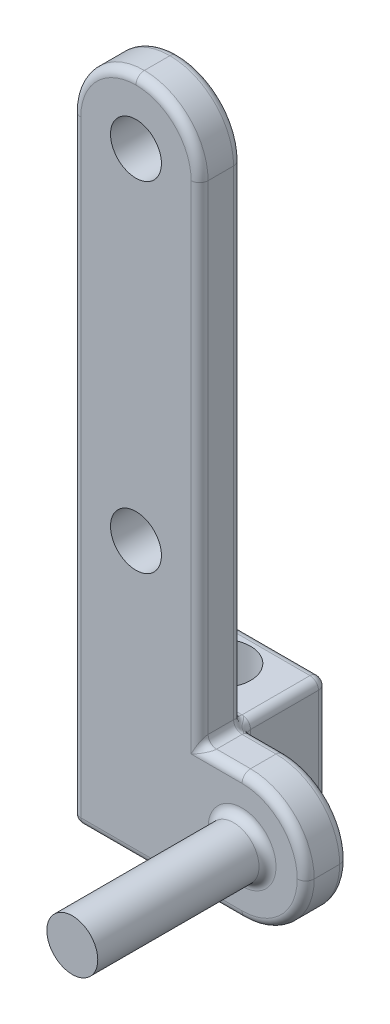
ISO-10303-21;
HEADER;
FILE_DESCRIPTION(('STEP AP214'),'2;1');
FILE_NAME('part.step','',(''),(''),'','','');
FILE_SCHEMA(('AUTOMOTIVE_DESIGN { 1 0 10303 214 1 1 1 1 }'));
ENDSEC;
DATA;
#1=APPLICATION_CONTEXT('core data for automotive mechanical design processes');
#2=APPLICATION_PROTOCOL_DEFINITION('international standard','automotive_design',2000,#1);
#3=PRODUCT_CONTEXT('',#1,'mechanical');
#4=PRODUCT('Part','Part','',(#3));
#5=PRODUCT_RELATED_PRODUCT_CATEGORY('part','',(#4));
#6=PRODUCT_DEFINITION_FORMATION('','',#4);
#7=PRODUCT_DEFINITION_CONTEXT('part definition',#1,'design');
#8=PRODUCT_DEFINITION('design','',#6,#7);
#9=PRODUCT_DEFINITION_SHAPE('','',#8);
#10=(LENGTH_UNIT() NAMED_UNIT(*) SI_UNIT(.MILLI.,.METRE.));
#11=(NAMED_UNIT(*) PLANE_ANGLE_UNIT() SI_UNIT($,.RADIAN.));
#12=(NAMED_UNIT(*) SI_UNIT($,.STERADIAN.) SOLID_ANGLE_UNIT());
#13=UNCERTAINTY_MEASURE_WITH_UNIT(LENGTH_MEASURE(1.E-05),#10,'distance_accuracy_value','');
#14=(GEOMETRIC_REPRESENTATION_CONTEXT(3) GLOBAL_UNCERTAINTY_ASSIGNED_CONTEXT((#13)) GLOBAL_UNIT_ASSIGNED_CONTEXT((#10,
#11,#12)) REPRESENTATION_CONTEXT('',''));
#15=CARTESIAN_POINT('',(0.,0.,0.));
#16=DIRECTION('',(0.,0.,1.));
#17=DIRECTION('',(1.,0.,0.));
#18=AXIS2_PLACEMENT_3D('',#15,#16,#17);
#19=CARTESIAN_POINT('',(2.00000000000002,-132.,-2.));
#20=DIRECTION('',(0.,-1.,0.));
#21=DIRECTION('',(0.,0.,-1.));
#22=AXIS2_PLACEMENT_3D('',#19,#20,#21);
#23=TOROIDAL_SURFACE('',#22,4.,2.);
#24=CARTESIAN_POINT('',(-2.32520055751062,-130.026662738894,-1.95045314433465));
#25=CARTESIAN_POINT('',(-2.01551350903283,-129.97922487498,-0.0244395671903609));
#26=CARTESIAN_POINT('',(-2.3253317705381,-128.053325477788,0.0266375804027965));
#27=CARTESIAN_POINT('',(-2.27203494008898,-130.01785058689,-1.96624432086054));
#28=CARTESIAN_POINT('',(-2.00796034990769,-129.984987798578,-0.0169130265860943));
#29=CARTESIAN_POINT('',(-2.27209007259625,-128.035701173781,0.0178404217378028));
#30=CARTESIAN_POINT('',(-2.21813083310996,-130.011186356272,-1.97862574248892));
#31=CARTESIAN_POINT('',(-2.00408335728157,-129.990177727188,-0.0108052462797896));
#32=CARTESIAN_POINT('',(-2.21815390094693,-128.022372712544,0.0111827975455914));
#33=CARTESIAN_POINT('',(-2.10949179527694,-130.002256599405,-1.99550947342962));
#34=CARTESIAN_POINT('',(-2.00009267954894,-129.997708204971,-0.00231972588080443));
#35=CARTESIAN_POINT('',(-2.10948801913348,-128.00451319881,0.00225844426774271));
#36=CARTESIAN_POINT('',(-2.05475585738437,-129.999996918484,-2.00000131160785));
#37=CARTESIAN_POINT('',(-2.00000755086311,-130.000018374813,2.09111934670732E-05));
#38=CARTESIAN_POINT('',(-2.05475735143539,-127.999993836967,-2.44985942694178E-06));
#39=CARTESIAN_POINT('',(-1.91492042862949,-130.000004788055,-1.99999796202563));
#40=CARTESIAN_POINT('',(-1.99998826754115,-129.999971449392,-3.24916121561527E-05));
#41=CARTESIAN_POINT('',(-1.91491810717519,-128.000009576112,3.80658800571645E-06));
#42=CARTESIAN_POINT('',(-1.82979276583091,-130.005472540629,-1.98914815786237));
#43=CARTESIAN_POINT('',(-2.00016363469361,-129.994330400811,-0.00575699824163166));
#44=CARTESIAN_POINT('',(-1.82977179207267,-128.010945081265,0.0054719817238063));
#45=CARTESIAN_POINT('',(-1.66208700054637,-130.026890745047,-1.94137811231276));
#46=CARTESIAN_POINT('',(-1.98250584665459,-129.970743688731,-0.0245485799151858));
#47=CARTESIAN_POINT('',(-1.6622799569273,-128.053781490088,0.0269105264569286));
#48=CARTESIAN_POINT('',(-1.57950739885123,-130.042834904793,-1.90447351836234));
#49=CARTESIAN_POINT('',(-1.96499799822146,-129.953090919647,-0.0374119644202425));
#50=CARTESIAN_POINT('',(-1.57993278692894,-128.085669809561,0.0428745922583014));
#51=CARTESIAN_POINT('',(-1.4472176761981,-130.075911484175,-1.81890763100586));
#52=CARTESIAN_POINT('',(-1.90966238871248,-129.91943078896,-0.0540450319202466));
#53=CARTESIAN_POINT('',(-1.44986388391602,-128.151822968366,0.0764503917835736));
#54=CARTESIAN_POINT('',(-1.39672989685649,-130.090385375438,-1.77975711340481));
#55=CARTESIAN_POINT('',(-1.88235289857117,-129.905475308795,-0.0593704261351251));
#56=CARTESIAN_POINT('',(-1.4006776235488,-128.180770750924,0.0912295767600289));
#57=CARTESIAN_POINT('',(-1.29568408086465,-130.12211168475,-1.6872904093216));
#58=CARTESIAN_POINT('',(-1.81333157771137,-129.877670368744,-0.0639157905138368));
#59=CARTESIAN_POINT('',(-1.30435990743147,-128.244223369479,0.124186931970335));
#60=CARTESIAN_POINT('',(-1.24512602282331,-130.139365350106,-1.63396785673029));
#61=CARTESIAN_POINT('',(-1.77202369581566,-129.863877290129,-0.0632361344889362));
#62=CARTESIAN_POINT('',(-1.25722938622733,-128.278730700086,0.142366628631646));
#63=CARTESIAN_POINT('',(-1.14158726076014,-130.175797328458,-1.5107195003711));
#64=CARTESIAN_POINT('',(-1.67451781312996,-129.838516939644,-0.0518315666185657));
#65=CARTESIAN_POINT('',(-1.16487796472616,-128.351594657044,0.182003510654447));
#66=CARTESIAN_POINT('',(-1.088596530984,-130.194984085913,-1.44071884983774));
#67=CARTESIAN_POINT('',(-1.61873303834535,-129.826952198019,-0.0412978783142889));
#68=CARTESIAN_POINT('',(-1.11966678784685,-128.389968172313,0.203475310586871));
#69=CARTESIAN_POINT('',(-0.976330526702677,-130.233891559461,-1.28165769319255));
#70=CARTESIAN_POINT('',(-1.49320634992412,-129.8076779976,-0.00631605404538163));
#71=CARTESIAN_POINT('',(-1.03116481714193,-128.467783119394,0.249613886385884));
#72=CARTESIAN_POINT('',(-0.91705744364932,-130.253612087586,-1.19260382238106));
#73=CARTESIAN_POINT('',(-1.42392354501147,-129.799896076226,0.0177652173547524));
#74=CARTESIAN_POINT('',(-0.987873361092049,-128.507224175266,0.27427954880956));
#75=CARTESIAN_POINT('',(-0.8161010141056,-130.282728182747,-1.03996504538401));
#76=CARTESIAN_POINT('',(-1.30780831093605,-129.791136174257,0.0683156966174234));
#77=CARTESIAN_POINT('',(-0.922615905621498,-128.565456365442,0.314783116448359));
#78=CARTESIAN_POINT('',(-0.779090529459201,-130.292653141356,-0.983847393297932));
#79=CARTESIAN_POINT('',(-1.26595657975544,-129.788681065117,0.0882069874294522));
#80=CARTESIAN_POINT('',(-0.900112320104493,-128.585306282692,0.329379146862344));
#81=CARTESIAN_POINT('',(-0.699981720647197,-130.311643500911,-0.865757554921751));
#82=CARTESIAN_POINT('',(-1.1793537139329,-129.784831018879,0.133348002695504));
#83=CARTESIAN_POINT('',(-0.855469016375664,-128.623287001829,0.359641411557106));
#84=CARTESIAN_POINT('',(-0.657885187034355,-130.320709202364,-0.803787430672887));
#85=CARTESIAN_POINT('',(-1.13460643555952,-129.783421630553,0.15854840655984));
#86=CARTESIAN_POINT('',(-0.833329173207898,-128.641418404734,0.375307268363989));
#87=CARTESIAN_POINT('',(-0.567532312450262,-130.337411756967,-0.674997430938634));
#88=CARTESIAN_POINT('',(-1.04314416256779,-129.781445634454,0.214465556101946));
#89=CARTESIAN_POINT('',(-0.789503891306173,-128.674823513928,0.407694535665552));
#90=CARTESIAN_POINT('',(-0.519315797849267,-130.345057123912,-0.608210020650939));
#91=CARTESIAN_POINT('',(-0.996402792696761,-129.780863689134,0.245126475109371));
#92=CARTESIAN_POINT('',(-0.767816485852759,-128.69011424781,0.42440879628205));
#93=CARTESIAN_POINT('',(-0.415532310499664,-130.358384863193,-0.470964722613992));
#94=CARTESIAN_POINT('',(-0.901728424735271,-129.780206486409,0.312087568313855));
#95=CARTESIAN_POINT('',(-0.724786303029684,-128.716769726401,0.459029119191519));
#96=CARTESIAN_POINT('',(-0.359968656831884,-130.364068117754,-0.400508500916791));
#97=CARTESIAN_POINT('',(-0.853695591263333,-129.780125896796,0.348415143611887));
#98=CARTESIAN_POINT('',(-0.703443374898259,-128.728136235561,0.476934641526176));
#99=CARTESIAN_POINT('',(-0.252828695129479,-130.372044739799,-0.272093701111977));
#100=CARTESIAN_POINT('',(-0.767036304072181,-129.780130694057,0.418774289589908));
#101=CARTESIAN_POINT('',(-0.66526311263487,-128.744089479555,0.510371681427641));
#102=CARTESIAN_POINT('',(-0.202518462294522,-130.374778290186,-0.214318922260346));
#103=CARTESIAN_POINT('',(-0.72831163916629,-129.780186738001,0.451944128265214));
#104=CARTESIAN_POINT('',(-0.648343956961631,-128.749556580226,0.525703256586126));
#105=CARTESIAN_POINT('',(-0.0978675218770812,-130.37835356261,-0.0998609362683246));
#106=CARTESIAN_POINT('',(-0.652025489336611,-129.780273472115,0.520993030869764));
#107=CARTESIAN_POINT('',(-0.614937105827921,-128.756707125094,0.557042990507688));
#108=CARTESIAN_POINT('',(-0.0435275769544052,-130.379195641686,-0.0431775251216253));
#109=CARTESIAN_POINT('',(-0.614367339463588,-129.780304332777,0.55695010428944));
#110=CARTESIAN_POINT('',(-0.598449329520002,-128.758391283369,0.573051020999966));
#111=CARTESIAN_POINT('',(0.0677768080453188,-130.378911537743,0.0673409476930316));
#112=CARTESIAN_POINT('',(-0.54119834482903,-129.780295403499,0.630692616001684));
#113=CARTESIAN_POINT('',(-0.566042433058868,-128.75782307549,0.605620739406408));
#114=CARTESIAN_POINT('',(0.124741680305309,-130.37778502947,0.12117553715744));
#115=CARTESIAN_POINT('',(-0.505593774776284,-129.780255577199,0.668573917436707));
#116=CARTESIAN_POINT('',(-0.550123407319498,-128.755570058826,0.622182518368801));
#117=CARTESIAN_POINT('',(0.239495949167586,-130.373665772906,0.224662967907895));
#118=CARTESIAN_POINT('',(-0.437350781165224,-129.780165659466,0.745163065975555));
#119=CARTESIAN_POINT('',(-0.518977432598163,-128.747331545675,0.655717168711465));
#120=CARTESIAN_POINT('',(0.297285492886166,-130.370672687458,0.274315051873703));
#121=CARTESIAN_POINT('',(-0.404637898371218,-129.780115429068,0.78396645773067));
#122=CARTESIAN_POINT('',(-0.503750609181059,-128.741345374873,0.672690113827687));
#123=CARTESIAN_POINT('',(0.44019165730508,-130.361181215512,0.392050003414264));
#124=CARTESIAN_POINT('',(-0.327363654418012,-129.780155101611,0.880683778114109));
#125=CARTESIAN_POINT('',(-0.466739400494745,-128.722362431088,0.715376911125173));
#126=CARTESIAN_POINT('',(0.524730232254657,-130.353682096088,0.457146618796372));
#127=CARTESIAN_POINT('',(-0.28492821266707,-129.780328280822,0.938631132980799));
#128=CARTESIAN_POINT('',(-0.44542431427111,-128.707364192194,0.741273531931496));
#129=CARTESIAN_POINT('',(0.687532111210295,-130.336111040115,0.576949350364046));
#130=CARTESIAN_POINT('',(-0.20841486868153,-129.781558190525,1.05194243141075));
#131=CARTESIAN_POINT('',(-0.40451459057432,-128.672222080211,0.7935459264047));
#132=CARTESIAN_POINT('',(0.76578896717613,-130.326036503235,0.631644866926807));
#133=CARTESIAN_POINT('',(-0.174325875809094,-129.782627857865,1.10744555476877));
#134=CARTESIAN_POINT('',(-0.384921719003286,-128.652073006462,0.819922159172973));
#135=CARTESIAN_POINT('',(0.914717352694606,-130.304234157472,0.733197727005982));
#136=CARTESIAN_POINT('',(-0.113777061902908,-129.786151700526,1.21502543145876));
#137=CARTESIAN_POINT('',(-0.347180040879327,-128.608468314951,0.873382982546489));
#138=CARTESIAN_POINT('',(0.985318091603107,-130.292492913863,0.779983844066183));
#139=CARTESIAN_POINT('',(-0.0874542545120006,-129.788639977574,1.26709181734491));
#140=CARTESIAN_POINT('',(-0.329045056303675,-128.584985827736,0.900471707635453));
#141=CARTESIAN_POINT('',(1.11773507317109,-130.268237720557,0.867538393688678));
#142=CARTESIAN_POINT('',(-0.042014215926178,-129.795263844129,1.36650343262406));
#143=CARTESIAN_POINT('',(-0.29426873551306,-128.536475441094,0.955235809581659));
#144=CARTESIAN_POINT('',(1.17955299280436,-130.255723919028,0.908307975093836));
#145=CARTESIAN_POINT('',(-0.0229976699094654,-129.799426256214,1.41379826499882));
#146=CARTESIAN_POINT('',(-0.277627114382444,-128.511447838,0.982911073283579));
#147=CARTESIAN_POINT('',(1.33181880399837,-130.222452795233,1.010942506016));
#148=CARTESIAN_POINT('',(0.0191930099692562,-129.812722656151,1.53250888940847));
#149=CARTESIAN_POINT('',(-0.235461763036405,-128.444905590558,1.05701642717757));
#150=CARTESIAN_POINT('',(1.41511363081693,-130.201569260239,1.06951342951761));
#151=CARTESIAN_POINT('',(0.0364436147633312,-129.823311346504,1.59852773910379));
#152=CARTESIAN_POINT('',(-0.211108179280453,-128.403138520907,1.10406237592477));
#153=CARTESIAN_POINT('',(1.56187868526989,-130.161334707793,1.18255146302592));
#154=CARTESIAN_POINT('',(0.058354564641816,-129.847896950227,1.71524832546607));
#155=CARTESIAN_POINT('',(-0.165980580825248,-128.322669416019,1.20049840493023));
#156=CARTESIAN_POINT('',(1.62534432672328,-130.141984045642,1.23701762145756));
#157=CARTESIAN_POINT('',(0.0626565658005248,-129.861938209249,1.7653586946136));
#158=CARTESIAN_POINT('',(-0.145207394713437,-128.283968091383,1.24988902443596));
#159=CARTESIAN_POINT('',(1.73495099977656,-130.106223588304,1.34486567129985));
#160=CARTESIAN_POINT('',(0.0630409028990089,-129.891064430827,1.84962103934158));
#161=CARTESIAN_POINT('',(-0.107553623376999,-128.212447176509,1.35075390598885));
#162=CARTESIAN_POINT('',(1.78120890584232,-130.089794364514,1.39825245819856));
#163=CARTESIAN_POINT('',(0.0590021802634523,-129.906100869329,1.8833550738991));
#164=CARTESIAN_POINT('',(-0.0906470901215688,-128.179588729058,1.40221137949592));
#165=CARTESIAN_POINT('',(1.85923080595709,-130.060614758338,1.50581379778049));
#166=CARTESIAN_POINT('',(0.0472244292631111,-129.934647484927,1.93653854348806));
#167=CARTESIAN_POINT('',(-0.060877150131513,-128.12122951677,1.50726841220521));
#168=CARTESIAN_POINT('',(1.89100245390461,-130.047862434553,1.55998791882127));
#169=CARTESIAN_POINT('',(0.0394547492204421,-129.948056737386,1.95560893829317));
#170=CARTESIAN_POINT('',(-0.0480116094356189,-128.095724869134,1.56086682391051));
#171=CARTESIAN_POINT('',(1.95274702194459,-130.022116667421,1.69303731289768));
#172=CARTESIAN_POINT('',(0.0211315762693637,-129.975862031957,1.98833314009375));
#173=CARTESIAN_POINT('',(-0.02210891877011,-128.044233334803,1.6930793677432));
#174=CARTESIAN_POINT('',(1.97616495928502,-130.011343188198,1.7725869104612));
#175=CARTESIAN_POINT('',(0.0109892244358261,-129.987865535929,1.99557779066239));
#176=CARTESIAN_POINT('',(-0.0113420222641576,-128.022686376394,1.77260694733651));
#177=CARTESIAN_POINT('',(2.001320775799,-129.999483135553,1.93328239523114));
#178=CARTESIAN_POINT('',(-0.000411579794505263,-130.000705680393,2.00113510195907));
#179=CARTESIAN_POINT('',(0.00051452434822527,-127.998966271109,1.93327944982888));
#180=CARTESIAN_POINT('',(2.00300700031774,-129.998419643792,2.01443162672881));
#181=CARTESIAN_POINT('',(-0.00153100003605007,-130.001375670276,1.99934010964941));
#182=CARTESIAN_POINT('',(0.0015811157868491,-127.996839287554,2.01442776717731));
#183=CARTESIAN_POINT('',(1.98815216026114,-130.006103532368,2.17573448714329));
#184=CARTESIAN_POINT('',(0.00600546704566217,-129.994353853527,2.001491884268));
#185=CARTESIAN_POINT('',(-0.00610417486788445,-128.012207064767,2.17574067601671));
#186=CARTESIAN_POINT('',(1.97162819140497,-130.014841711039,2.25588897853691));
#187=CARTESIAN_POINT('',(0.0145823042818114,-129.986732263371,2.00540249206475));
#188=CARTESIAN_POINT('',(-0.0148468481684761,-128.029683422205,2.25590611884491));
#189=CARTESIAN_POINT('',(1.93576339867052,-130.03486041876,2.37347889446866));
#190=CARTESIAN_POINT('',(0.0312289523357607,-129.974046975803,2.02244529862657));
#191=CARTESIAN_POINT('',(-0.0348146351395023,-128.069720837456,2.37368855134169));
#192=CARTESIAN_POINT('',(1.92195960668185,-130.04268662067,2.41223985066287));
#193=CARTESIAN_POINT('',(0.0373612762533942,-129.969641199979,2.02992237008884));
#194=CARTESIAN_POINT('',(-0.0426142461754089,-128.085373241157,2.41254305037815));
#195=CARTESIAN_POINT('',(1.89105384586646,-130.060538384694,2.488649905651));
#196=CARTESIAN_POINT('',(0.0500327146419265,-129.961334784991,2.04890155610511));
#197=CARTESIAN_POINT('',(-0.0603603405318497,-128.121076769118,2.48922905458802));
#198=CARTESIAN_POINT('',(1.87395309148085,-130.070563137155,2.52629940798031));
#199=CARTESIAN_POINT('',(0.0565599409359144,-129.957436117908,2.0603601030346));
#200=CARTESIAN_POINT('',(-0.0703060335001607,-128.141126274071,2.52706093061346));
#201=CARTESIAN_POINT('',(1.8553963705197,-130.081637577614,2.56329375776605));
#202=CARTESIAN_POINT('',(0.0629262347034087,-129.954201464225,2.07403536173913));
#203=CARTESIAN_POINT('',(-0.0812585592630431,-128.163275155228,2.56429715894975));
#204=(BOUNDED_SURFACE() B_SPLINE_SURFACE(3,2,((#24,#25,#26),(#27,#28,#29),(#30,#31,#32),(#33,
#34,#35),(#36,#37,#38),(#39,#40,#41),(#42,#43,#44),(#45,#46,#47),(#48,#49,#50),(#51,#52,#53),
(#54,#55,#56),(#57,#58,#59),(#60,#61,#62),(#63,#64,#65),(#66,#67,#68),(#69,#70,#71),(#72,#73,
#74),(#75,#76,#77),(#78,#79,#80),(#81,#82,#83),(#84,#85,#86),(#87,#88,#89),(#90,#91,#92),(#93,
#94,#95),(#96,#97,#98),(#99,#100,#101),(#102,#103,#104),(#105,#106,#107),(#108,#109,#110),(#111,
#112,#113),(#114,#115,#116),(#117,#118,#119),(#120,#121,#122),(#123,#124,#125),(#126,#127,#128),
(#129,#130,#131),(#132,#133,#134),(#135,#136,#137),(#138,#139,#140),(#141,#142,#143),(#144,#145,
#146),(#147,#148,#149),(#150,#151,#152),(#153,#154,#155),(#156,#157,#158),(#159,#160,#161),
(#162,#163,#164),(#165,#166,#167),(#168,#169,#170),(#171,#172,#173),(#174,#175,#176),(#177,#178,
#179),(#180,#181,#182),(#183,#184,#185),(#186,#187,#188),(#189,#190,#191),(#192,#193,#194),
(#195,#196,#197),(#198,#199,#200),(#201,#202,#203)),.UNSPECIFIED.,.F.,.F.,
.F.) B_SPLINE_SURFACE_WITH_KNOTS((4,2,2,2,2,2,2,2,2,2,2,2,2,2,2,2,2,2,2,2,2,2,2,2,2,2,2,2,2,4),
(3,3),(0.,0.327830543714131,0.656095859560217,1.16615402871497,1.67590613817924,
1.99563715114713,2.31551203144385,2.63685039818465,2.95807704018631,3.12962765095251,
3.30111804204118,3.47154474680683,3.64189472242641,3.7797015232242,3.91748230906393,
4.05528586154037,4.19311431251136,4.39891358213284,4.60492146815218,4.8126956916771,
5.0204301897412,5.36175258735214,5.70315386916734,6.04219208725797,6.38105096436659,
6.86453268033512,7.34916338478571,7.8333395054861,8.07548734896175,8.31754616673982),(0.,1.),
.UNSPECIFIED.) GEOMETRIC_REPRESENTATION_ITEM() RATIONAL_B_SPLINE_SURFACE(((1.,0.715762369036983,
1.),(1.,0.713031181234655,1.),(1.,0.710867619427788,1.),(1.,0.707903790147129,1.),(1.,
0.707105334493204,1.),(1.,0.707109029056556,1.),(1.,0.709042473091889,1.),(1.,0.717343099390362,
1.),(1.,0.723707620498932,1.),(1.,0.737668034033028,1.),(1.,0.7439205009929,1.),(1.,
0.758039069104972,1.),(1.,0.76590589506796,1.),(1.,0.783012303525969,1.),(1.,0.792258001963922,
1.),(1.,0.811567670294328,1.),(1.,0.821631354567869,1.),(1.,0.836902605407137,1.),(1.,
0.842187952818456,1.),(1.,0.852438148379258,1.),(1.,0.857403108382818,1.),(1.,0.866658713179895,
1.),(1.,0.870953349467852,1.),(1.,0.878506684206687,1.),(1.,0.881765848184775,1.),(1.,
0.886363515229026,1.),(1.,0.887949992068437,1.),(1.,0.890027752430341,1.),(1.,0.890519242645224,
1.),(1.,0.890353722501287,1.),(1.,0.889696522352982,1.),(1.,0.887304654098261,1.),(1.,
0.885569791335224,1.),(1.,0.880107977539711,1.),(1.,0.875820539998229,1.),(1.,0.865930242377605,
1.),(1.,0.860326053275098,1.),(1.,0.848408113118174,1.),(1.,0.842088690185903,1.),(1.,
0.829269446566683,1.),(1.,0.822769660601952,1.),(1.,0.805802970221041,1.),(1.,0.795472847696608,
1.),(1.,0.776128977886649,1.),(1.,0.767115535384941,1.),(1.,0.750891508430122,1.),(1.,
0.743668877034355,1.),(1.,0.731153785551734,1.),(1.,0.725860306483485,1.),(1.,0.715421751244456,
1.),(1.,0.711304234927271,1.),(1.,0.706877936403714,1.),(1.,0.706578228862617,1.),(1.,
0.709196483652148,1.),(1.,0.712111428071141,1.),(1.,0.718295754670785,1.),(1.,0.720659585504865,
1.),(1.,0.725891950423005,1.),(1.,0.728760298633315,1.),(1.,0.731832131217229,1.))) REPRESENTATION_ITEM('') SURFACE());
#205=CARTESIAN_POINT('',(1.8553963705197,-130.081637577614,2.56329375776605));
#206=CARTESIAN_POINT('',(1.87395309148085,-130.070563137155,2.52629940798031));
#207=CARTESIAN_POINT('',(1.89105384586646,-130.060538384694,2.488649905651));
#208=CARTESIAN_POINT('',(1.92195960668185,-130.04268662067,2.41223985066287));
#209=CARTESIAN_POINT('',(1.93576339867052,-130.03486041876,2.37347889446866));
#210=CARTESIAN_POINT('',(1.97162819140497,-130.014841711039,2.25588897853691));
#211=CARTESIAN_POINT('',(1.98815216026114,-130.006103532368,2.17573448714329));
#212=CARTESIAN_POINT('',(2.00300700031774,-129.998419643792,2.01443162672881));
#213=CARTESIAN_POINT('',(2.001320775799,-129.999483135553,1.93328239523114));
#214=CARTESIAN_POINT('',(1.97616495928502,-130.011343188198,1.7725869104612));
#215=CARTESIAN_POINT('',(1.95274702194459,-130.022116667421,1.69303731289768));
#216=CARTESIAN_POINT('',(1.89100245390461,-130.047862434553,1.55998791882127));
#217=CARTESIAN_POINT('',(1.85923080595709,-130.060614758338,1.50581379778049));
#218=CARTESIAN_POINT('',(1.78120890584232,-130.089794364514,1.39825245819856));
#219=CARTESIAN_POINT('',(1.73495099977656,-130.106223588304,1.34486567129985));
#220=CARTESIAN_POINT('',(1.62534432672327,-130.141984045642,1.23701762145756));
#221=CARTESIAN_POINT('',(1.56187868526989,-130.161334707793,1.18255146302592));
#222=CARTESIAN_POINT('',(1.41511363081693,-130.201569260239,1.06951342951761));
#223=CARTESIAN_POINT('',(1.33181880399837,-130.222452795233,1.010942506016));
#224=CARTESIAN_POINT('',(1.17955299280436,-130.255723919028,0.908307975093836));
#225=CARTESIAN_POINT('',(1.11773507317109,-130.268237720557,0.867538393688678));
#226=CARTESIAN_POINT('',(0.985318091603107,-130.292492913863,0.779983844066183));
#227=CARTESIAN_POINT('',(0.914717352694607,-130.304234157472,0.733197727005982));
#228=CARTESIAN_POINT('',(0.76578896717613,-130.326036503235,0.631644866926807));
#229=CARTESIAN_POINT('',(0.687532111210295,-130.336111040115,0.576949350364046));
#230=CARTESIAN_POINT('',(0.524730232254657,-130.353682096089,0.457146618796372));
#231=CARTESIAN_POINT('',(0.44019165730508,-130.361181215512,0.392050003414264));
#232=CARTESIAN_POINT('',(0.297285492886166,-130.370672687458,0.274315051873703));
#233=CARTESIAN_POINT('',(0.239495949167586,-130.373665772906,0.224662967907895));
#234=CARTESIAN_POINT('',(0.124741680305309,-130.37778502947,0.12117553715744));
#235=CARTESIAN_POINT('',(0.0677768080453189,-130.378911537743,0.0673409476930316));
#236=CARTESIAN_POINT('',(-0.0435275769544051,-130.379195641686,-0.0431775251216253));
#237=CARTESIAN_POINT('',(-0.0978675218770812,-130.37835356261,-0.0998609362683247));
#238=CARTESIAN_POINT('',(-0.202518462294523,-130.374778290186,-0.214318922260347));
#239=CARTESIAN_POINT('',(-0.252828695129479,-130.372044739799,-0.272093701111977));
#240=CARTESIAN_POINT('',(-0.359968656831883,-130.364068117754,-0.400508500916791));
#241=CARTESIAN_POINT('',(-0.415532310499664,-130.358384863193,-0.470964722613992));
#242=CARTESIAN_POINT('',(-0.519315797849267,-130.345057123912,-0.60821002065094));
#243=CARTESIAN_POINT('',(-0.567532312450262,-130.337411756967,-0.674997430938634));
#244=CARTESIAN_POINT('',(-0.657885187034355,-130.320709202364,-0.803787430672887));
#245=CARTESIAN_POINT('',(-0.699981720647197,-130.311643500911,-0.86575755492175));
#246=CARTESIAN_POINT('',(-0.7790905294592,-130.292653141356,-0.983847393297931));
#247=CARTESIAN_POINT('',(-0.8161010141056,-130.282728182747,-1.03996504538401));
#248=CARTESIAN_POINT('',(-0.91705744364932,-130.253612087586,-1.19260382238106));
#249=CARTESIAN_POINT('',(-0.976330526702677,-130.233891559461,-1.28165769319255));
#250=CARTESIAN_POINT('',(-1.088596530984,-130.194984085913,-1.44071884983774));
#251=CARTESIAN_POINT('',(-1.14158726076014,-130.175797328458,-1.5107195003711));
#252=CARTESIAN_POINT('',(-1.24512602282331,-130.139365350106,-1.63396785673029));
#253=CARTESIAN_POINT('',(-1.29568408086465,-130.12211168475,-1.6872904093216));
#254=CARTESIAN_POINT('',(-1.39672989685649,-130.090385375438,-1.77975711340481));
#255=CARTESIAN_POINT('',(-1.4472176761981,-130.075911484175,-1.81890763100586));
#256=CARTESIAN_POINT('',(-1.57950739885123,-130.042834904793,-1.90447351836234));
#257=CARTESIAN_POINT('',(-1.66208700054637,-130.026890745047,-1.94137811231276));
#258=CARTESIAN_POINT('',(-1.82979276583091,-130.005472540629,-1.98914815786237));
#259=CARTESIAN_POINT('',(-1.91492042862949,-130.000004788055,-1.99999796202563));
#260=CARTESIAN_POINT('',(-2.05475585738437,-129.999996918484,-2.00000131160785));
#261=CARTESIAN_POINT('',(-2.10949179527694,-130.002256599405,-1.99550947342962));
#262=CARTESIAN_POINT('',(-2.21813083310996,-130.011186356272,-1.97862574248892));
#263=CARTESIAN_POINT('',(-2.27203494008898,-130.01785058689,-1.96624432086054));
#264=CARTESIAN_POINT('',(-2.32520055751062,-130.026662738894,-1.95045314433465));
#265=B_SPLINE_CURVE_WITH_KNOTS('',3,(#205,#206,#207,#208,#209,#210,#211,#212,#213,#214,#215,
#216,#217,#218,#219,#220,#221,#222,#223,#224,#225,#226,#227,#228,#229,#230,#231,#232,#233,#234,
#235,#236,#237,#238,#239,#240,#241,#242,#243,#244,#245,#246,#247,#248,#249,#250,#251,#252,#253,
#254,#255,#256,#257,#258,#259,#260,#261,#262,#263,#264),.UNSPECIFIED.,.F.,.F.,(4,2,2,2,2,2,2,2,
2,2,2,2,2,2,2,2,2,2,2,2,2,2,2,2,2,2,2,2,2,4),(0.,0.242058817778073,0.484206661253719,
0.968382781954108,1.4530134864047,1.93649520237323,2.27535407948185,2.61439229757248,
2.95579357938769,3.29711597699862,3.50485047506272,3.71262469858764,3.91863258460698,
4.12443185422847,4.26226030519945,4.4000638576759,4.53784464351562,4.67565144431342,
4.84600141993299,5.01642812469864,5.18791851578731,5.35946912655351,5.68069576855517,
6.00203413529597,6.32190901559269,6.64164002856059,7.15139213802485,7.6614503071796,
7.98971562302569,8.31754616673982),.UNSPECIFIED.);
#266=CARTESIAN_POINT('',(2.00000000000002,-130.,2.));
#267=VERTEX_POINT('',#266);
#268=CARTESIAN_POINT('',(0.,-130.379069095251,0.));
#269=VERTEX_POINT('',#268);
#270=EDGE_CURVE('E434',#267,#269,#265,.T.);
#271=ORIENTED_EDGE('',*,*,#270,.F.);
#272=CARTESIAN_POINT('',(2.00000000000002,-132.,2.));
#273=DIRECTION('',(1.,0.,0.));
#274=DIRECTION('',(0.,0.,-1.));
#275=AXIS2_PLACEMENT_3D('',#272,#273,#274);
#276=CIRCLE('',#275,2.);
#277=CARTESIAN_POINT('',(2.00000000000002,-132.,0.));
#278=VERTEX_POINT('',#277);
#279=EDGE_CURVE('E319',#278,#267,#276,.T.);
#280=ORIENTED_EDGE('',*,*,#279,.F.);
#281=CARTESIAN_POINT('',(2.00000000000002,-132.,-2.));
#282=DIRECTION('',(0.,-1.,0.));
#283=DIRECTION('',(0.,0.,-1.));
#284=AXIS2_PLACEMENT_3D('',#281,#282,#283);
#285=CIRCLE('',#284,2.);
#286=CARTESIAN_POINT('',(0.,-132.,-2.));
#287=VERTEX_POINT('',#286);
#288=EDGE_CURVE('E279',#287,#278,#285,.F.);
#289=ORIENTED_EDGE('',*,*,#288,.F.);
#290=CARTESIAN_POINT('',(-1.99999999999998,-132.,-2.));
#291=DIRECTION('',(0.,0.,1.));
#292=DIRECTION('',(1.,0.,0.));
#293=AXIS2_PLACEMENT_3D('',#290,#291,#292);
#294=CIRCLE('',#293,2.);
#295=CARTESIAN_POINT('',(-1.99999999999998,-130.,-2.));
#296=VERTEX_POINT('',#295);
#297=EDGE_CURVE('E322',#287,#296,#294,.T.);
#298=ORIENTED_EDGE('',*,*,#297,.T.);
#299=CARTESIAN_POINT('',(1.8553963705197,-130.081637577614,2.56329375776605));
#300=CARTESIAN_POINT('',(1.87395309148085,-130.070563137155,2.52629940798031));
#301=CARTESIAN_POINT('',(1.89105384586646,-130.060538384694,2.488649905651));
#302=CARTESIAN_POINT('',(1.92195960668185,-130.04268662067,2.41223985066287));
#303=CARTESIAN_POINT('',(1.93576339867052,-130.03486041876,2.37347889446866));
#304=CARTESIAN_POINT('',(1.97162819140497,-130.014841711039,2.25588897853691));
#305=CARTESIAN_POINT('',(1.98815216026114,-130.006103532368,2.17573448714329));
#306=CARTESIAN_POINT('',(2.00300700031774,-129.998419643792,2.01443162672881));
#307=CARTESIAN_POINT('',(2.001320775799,-129.999483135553,1.93328239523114));
#308=CARTESIAN_POINT('',(1.97616495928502,-130.011343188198,1.7725869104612));
#309=CARTESIAN_POINT('',(1.95274702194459,-130.022116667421,1.69303731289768));
#310=CARTESIAN_POINT('',(1.89100245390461,-130.047862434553,1.55998791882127));
#311=CARTESIAN_POINT('',(1.85923080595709,-130.060614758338,1.50581379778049));
#312=CARTESIAN_POINT('',(1.78120890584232,-130.089794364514,1.39825245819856));
#313=CARTESIAN_POINT('',(1.73495099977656,-130.106223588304,1.34486567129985));
#314=CARTESIAN_POINT('',(1.62534432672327,-130.141984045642,1.23701762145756));
#315=CARTESIAN_POINT('',(1.56187868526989,-130.161334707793,1.18255146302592));
#316=CARTESIAN_POINT('',(1.41511363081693,-130.201569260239,1.06951342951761));
#317=CARTESIAN_POINT('',(1.33181880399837,-130.222452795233,1.010942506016));
#318=CARTESIAN_POINT('',(1.17955299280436,-130.255723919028,0.908307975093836));
#319=CARTESIAN_POINT('',(1.11773507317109,-130.268237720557,0.867538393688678));
#320=CARTESIAN_POINT('',(0.985318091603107,-130.292492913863,0.779983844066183));
#321=CARTESIAN_POINT('',(0.914717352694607,-130.304234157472,0.733197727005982));
#322=CARTESIAN_POINT('',(0.76578896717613,-130.326036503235,0.631644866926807));
#323=CARTESIAN_POINT('',(0.687532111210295,-130.336111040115,0.576949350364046));
#324=CARTESIAN_POINT('',(0.524730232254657,-130.353682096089,0.457146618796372));
#325=CARTESIAN_POINT('',(0.44019165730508,-130.361181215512,0.392050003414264));
#326=CARTESIAN_POINT('',(0.297285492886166,-130.370672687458,0.274315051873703));
#327=CARTESIAN_POINT('',(0.239495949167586,-130.373665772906,0.224662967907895));
#328=CARTESIAN_POINT('',(0.124741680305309,-130.37778502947,0.12117553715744));
#329=CARTESIAN_POINT('',(0.0677768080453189,-130.378911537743,0.0673409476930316));
#330=CARTESIAN_POINT('',(-0.0435275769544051,-130.379195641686,-0.0431775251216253));
#331=CARTESIAN_POINT('',(-0.0978675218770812,-130.37835356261,-0.0998609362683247));
#332=CARTESIAN_POINT('',(-0.202518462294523,-130.374778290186,-0.214318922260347));
#333=CARTESIAN_POINT('',(-0.252828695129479,-130.372044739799,-0.272093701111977));
#334=CARTESIAN_POINT('',(-0.359968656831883,-130.364068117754,-0.400508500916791));
#335=CARTESIAN_POINT('',(-0.415532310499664,-130.358384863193,-0.470964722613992));
#336=CARTESIAN_POINT('',(-0.519315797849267,-130.345057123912,-0.60821002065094));
#337=CARTESIAN_POINT('',(-0.567532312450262,-130.337411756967,-0.674997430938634));
#338=CARTESIAN_POINT('',(-0.657885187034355,-130.320709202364,-0.803787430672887));
#339=CARTESIAN_POINT('',(-0.699981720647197,-130.311643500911,-0.86575755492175));
#340=CARTESIAN_POINT('',(-0.7790905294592,-130.292653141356,-0.983847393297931));
#341=CARTESIAN_POINT('',(-0.8161010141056,-130.282728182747,-1.03996504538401));
#342=CARTESIAN_POINT('',(-0.91705744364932,-130.253612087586,-1.19260382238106));
#343=CARTESIAN_POINT('',(-0.976330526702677,-130.233891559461,-1.28165769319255));
#344=CARTESIAN_POINT('',(-1.088596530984,-130.194984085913,-1.44071884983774));
#345=CARTESIAN_POINT('',(-1.14158726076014,-130.175797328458,-1.5107195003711));
#346=CARTESIAN_POINT('',(-1.24512602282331,-130.139365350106,-1.63396785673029));
#347=CARTESIAN_POINT('',(-1.29568408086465,-130.12211168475,-1.6872904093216));
#348=CARTESIAN_POINT('',(-1.39672989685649,-130.090385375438,-1.77975711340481));
#349=CARTESIAN_POINT('',(-1.4472176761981,-130.075911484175,-1.81890763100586));
#350=CARTESIAN_POINT('',(-1.57950739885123,-130.042834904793,-1.90447351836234));
#351=CARTESIAN_POINT('',(-1.66208700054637,-130.026890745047,-1.94137811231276));
#352=CARTESIAN_POINT('',(-1.82979276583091,-130.005472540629,-1.98914815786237));
#353=CARTESIAN_POINT('',(-1.91492042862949,-130.000004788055,-1.99999796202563));
#354=CARTESIAN_POINT('',(-2.05475585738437,-129.999996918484,-2.00000131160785));
#355=CARTESIAN_POINT('',(-2.10949179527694,-130.002256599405,-1.99550947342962));
#356=CARTESIAN_POINT('',(-2.21813083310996,-130.011186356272,-1.97862574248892));
#357=CARTESIAN_POINT('',(-2.27203494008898,-130.01785058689,-1.96624432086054));
#358=CARTESIAN_POINT('',(-2.32520055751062,-130.026662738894,-1.95045314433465));
#359=B_SPLINE_CURVE_WITH_KNOTS('',3,(#299,#300,#301,#302,#303,#304,#305,#306,#307,#308,#309,
#310,#311,#312,#313,#314,#315,#316,#317,#318,#319,#320,#321,#322,#323,#324,#325,#326,#327,#328,
#329,#330,#331,#332,#333,#334,#335,#336,#337,#338,#339,#340,#341,#342,#343,#344,#345,#346,#347,
#348,#349,#350,#351,#352,#353,#354,#355,#356,#357,#358),.UNSPECIFIED.,.F.,.F.,(4,2,2,2,2,2,2,2,
2,2,2,2,2,2,2,2,2,2,2,2,2,2,2,2,2,2,2,2,2,4),(0.,0.242058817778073,0.484206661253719,
0.968382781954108,1.4530134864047,1.93649520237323,2.27535407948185,2.61439229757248,
2.95579357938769,3.29711597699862,3.50485047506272,3.71262469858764,3.91863258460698,
4.12443185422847,4.26226030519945,4.4000638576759,4.53784464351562,4.67565144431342,
4.84600141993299,5.01642812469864,5.18791851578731,5.35946912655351,5.68069576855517,
6.00203413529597,6.32190901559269,6.64164002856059,7.15139213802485,7.6614503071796,
7.98971562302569,8.31754616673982),.UNSPECIFIED.);
#360=EDGE_CURVE('E426',#269,#296,#359,.T.);
#361=ORIENTED_EDGE('',*,*,#360,.F.);
#362=EDGE_LOOP('',(#271,#280,#289,#298,#361));
#363=FACE_BOUND('',#362,.T.);
#364=ADVANCED_FACE('F35',(#363),#23,.T.);
#365=CARTESIAN_POINT('',(0.,-130.,10.));
#366=DIRECTION('',(0.,-1.,0.));
#367=DIRECTION('',(0.,0.,-1.));
#368=AXIS2_PLACEMENT_3D('',#365,#366,#367);
#369=PLANE('',#368);
#370=CARTESIAN_POINT('',(-15.,-130.,-10.));
#371=DIRECTION('',(0.,-1.,0.));
#372=DIRECTION('',(0.,0.,-1.));
#373=AXIS2_PLACEMENT_3D('',#370,#371,#372);
#374=CIRCLE('',#373,7.);
#375=CARTESIAN_POINT('',(-15.,-130.,-17.));
#376=VERTEX_POINT('',#375);
#377=EDGE_CURVE('E710',#376,#376,#374,.T.);
#378=ORIENTED_EDGE('',*,*,#377,.T.);
#379=EDGE_LOOP('',(#378));
#380=FACE_BOUND('',#379,.T.);
#381=DIRECTION('',(1.,0.,0.));
#382=VECTOR('',#381,1.);
#383=CARTESIAN_POINT('',(-30.,-130.,-18.));
#384=LINE('',#383,#382);
#385=CARTESIAN_POINT('',(-1.99999999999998,-130.,-18.));
#386=VERTEX_POINT('',#385);
#387=CARTESIAN_POINT('',(-28.,-130.,-18.));
#388=VERTEX_POINT('',#387);
#389=EDGE_CURVE('E231',#386,#388,#384,.F.);
#390=ORIENTED_EDGE('',*,*,#389,.T.);
#391=DIRECTION('',(0.,0.,1.));
#392=VECTOR('',#391,1.);
#393=CARTESIAN_POINT('',(-28.,-130.,10.));
#394=LINE('',#393,#392);
#395=CARTESIAN_POINT('',(-28.,-130.,-2.));
#396=VERTEX_POINT('',#395);
#397=EDGE_CURVE('E620',#388,#396,#394,.T.);
#398=ORIENTED_EDGE('',*,*,#397,.T.);
#399=DIRECTION('',(1.,0.,0.));
#400=VECTOR('',#399,1.);
#401=CARTESIAN_POINT('',(0.,-130.,-2.));
#402=LINE('',#401,#400);
#403=EDGE_CURVE('E541',#396,#296,#402,.T.);
#404=ORIENTED_EDGE('',*,*,#403,.T.);
#405=DIRECTION('',(0.,0.,1.));
#406=VECTOR('',#405,1.);
#407=CARTESIAN_POINT('',(-1.99999999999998,-130.,10.));
#408=LINE('',#407,#406);
#409=EDGE_CURVE('E297',#296,#386,#408,.F.);
#410=ORIENTED_EDGE('',*,*,#409,.T.);
#411=EDGE_LOOP('',(#390,#398,#404,#410));
#412=FACE_BOUND('',#411,.T.);
#413=ADVANCED_FACE('F527',(#380,#412),#369,.F.);
#414=CARTESIAN_POINT('',(-30.,0.,0.));
#415=DIRECTION('',(0.,0.,-1.));
#416=DIRECTION('',(-1.,0.,0.));
#417=AXIS2_PLACEMENT_3D('',#414,#415,#416);
#418=PLANE('',#417);
#419=CARTESIAN_POINT('',(-15.,-15.,0.));
#420=DIRECTION('',(0.,0.,-1.));
#421=DIRECTION('',(-1.,0.,0.));
#422=AXIS2_PLACEMENT_3D('',#419,#420,#421);
#423=CIRCLE('',#422,13.);
#424=CARTESIAN_POINT('',(-15.,-2.,0.));
#425=VERTEX_POINT('',#424);
#426=CARTESIAN_POINT('',(-2.,-15.,0.));
#427=VERTEX_POINT('',#426);
#428=EDGE_CURVE('E410',#425,#427,#423,.T.);
#429=ORIENTED_EDGE('',*,*,#428,.T.);
#430=DIRECTION('',(0.,1.,0.));
#431=VECTOR('',#430,1.);
#432=CARTESIAN_POINT('',(-1.99999999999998,-130.379069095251,0.));
#433=LINE('',#432,#431);
#434=CARTESIAN_POINT('',(-1.99999999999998,-128.,0.));
#435=VERTEX_POINT('',#434);
#436=EDGE_CURVE('E412',#427,#435,#433,.F.);
#437=ORIENTED_EDGE('',*,*,#436,.T.);
#438=DIRECTION('',(1.,0.,0.));
#439=VECTOR('',#438,1.);
#440=CARTESIAN_POINT('',(-30.,-128.,0.));
#441=LINE('',#440,#439);
#442=CARTESIAN_POINT('',(-28.,-128.,0.));
#443=VERTEX_POINT('',#442);
#444=EDGE_CURVE('E404',#435,#443,#441,.F.);
#445=ORIENTED_EDGE('',*,*,#444,.T.);
#446=DIRECTION('',(0.,-1.,0.));
#447=VECTOR('',#446,1.);
#448=CARTESIAN_POINT('',(-28.,-15.,0.));
#449=LINE('',#448,#447);
#450=CARTESIAN_POINT('',(-28.,-15.,0.));
#451=VERTEX_POINT('',#450);
#452=EDGE_CURVE('E406',#443,#451,#449,.F.);
#453=ORIENTED_EDGE('',*,*,#452,.T.);
#454=CARTESIAN_POINT('',(-15.,-15.,0.));
#455=DIRECTION('',(0.,0.,-1.));
#456=DIRECTION('',(-1.,0.,0.));
#457=AXIS2_PLACEMENT_3D('',#454,#455,#456);
#458=CIRCLE('',#457,13.);
#459=EDGE_CURVE('E408',#451,#425,#458,.T.);
#460=ORIENTED_EDGE('',*,*,#459,.T.);
#461=EDGE_LOOP('',(#429,#437,#445,#453,#460));
#462=FACE_BOUND('',#461,.T.);
#463=CARTESIAN_POINT('',(-15.,-95.,0.));
#464=DIRECTION('',(0.,0.,-1.));
#465=DIRECTION('',(-1.,0.,0.));
#466=AXIS2_PLACEMENT_3D('',#463,#464,#465);
#467=CIRCLE('',#466,6.);
#468=CARTESIAN_POINT('',(-21.,-95.,0.));
#469=VERTEX_POINT('',#468);
#470=EDGE_CURVE('E720',#469,#469,#467,.T.);
#471=ORIENTED_EDGE('',*,*,#470,.F.);
#472=EDGE_LOOP('',(#471));
#473=FACE_BOUND('',#472,.T.);
#474=CARTESIAN_POINT('',(-15.,-15.,0.));
#475=DIRECTION('',(0.,0.,-1.));
#476=DIRECTION('',(-1.,0.,0.));
#477=AXIS2_PLACEMENT_3D('',#474,#475,#476);
#478=CIRCLE('',#477,6.);
#479=CARTESIAN_POINT('',(-21.,-15.,0.));
#480=VERTEX_POINT('',#479);
#481=EDGE_CURVE('E726',#480,#480,#478,.T.);
#482=ORIENTED_EDGE('',*,*,#481,.F.);
#483=EDGE_LOOP('',(#482));
#484=FACE_BOUND('',#483,.T.);
#485=ADVANCED_FACE('F532',(#462,#473,#484),#418,.T.);
#486=CARTESIAN_POINT('',(-30.,0.,10.));
#487=DIRECTION('',(0.,0.,-1.));
#488=DIRECTION('',(-1.,0.,0.));
#489=AXIS2_PLACEMENT_3D('',#486,#487,#488);
#490=PLANE('',#489);
#491=CARTESIAN_POINT('',(10.,-145.,10.));
#492=DIRECTION('',(0.,0.,-1.));
#493=DIRECTION('',(-1.,0.,0.));
#494=AXIS2_PLACEMENT_3D('',#491,#492,#493);
#495=CIRCLE('',#494,8.);
#496=CARTESIAN_POINT('',(2.00000000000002,-145.,10.));
#497=VERTEX_POINT('',#496);
#498=EDGE_CURVE('E344',#497,#497,#495,.T.);
#499=ORIENTED_EDGE('',*,*,#498,.T.);
#500=EDGE_LOOP('',(#499));
#501=FACE_BOUND('',#500,.T.);
#502=DIRECTION('',(0.,-1.,0.));
#503=VECTOR('',#502,1.);
#504=CARTESIAN_POINT('',(-28.,0.,10.));
#505=LINE('',#504,#503);
#506=CARTESIAN_POINT('',(-28.,-15.,10.));
#507=VERTEX_POINT('',#506);
#508=CARTESIAN_POINT('',(-28.,-158.,10.));
#509=VERTEX_POINT('',#508);
#510=EDGE_CURVE('E337',#507,#509,#505,.T.);
#511=ORIENTED_EDGE('',*,*,#510,.T.);
#512=DIRECTION('',(1.,0.,0.));
#513=VECTOR('',#512,1.);
#514=CARTESIAN_POINT('',(-30.,-158.,10.));
#515=LINE('',#514,#513);
#516=CARTESIAN_POINT('',(10.,-158.,10.));
#517=VERTEX_POINT('',#516);
#518=EDGE_CURVE('E342',#509,#517,#515,.T.);
#519=ORIENTED_EDGE('',*,*,#518,.T.);
#520=CARTESIAN_POINT('',(10.,-145.,10.));
#521=DIRECTION('',(0.,0.,-1.));
#522=DIRECTION('',(-1.,0.,0.));
#523=AXIS2_PLACEMENT_3D('',#520,#521,#522);
#524=CIRCLE('',#523,13.);
#525=CARTESIAN_POINT('',(23.,-145.,10.));
#526=VERTEX_POINT('',#525);
#527=EDGE_CURVE('E340',#517,#526,#524,.F.);
#528=ORIENTED_EDGE('',*,*,#527,.T.);
#529=CARTESIAN_POINT('',(10.,-145.,10.));
#530=DIRECTION('',(0.,0.,-1.));
#531=DIRECTION('',(-1.,0.,0.));
#532=AXIS2_PLACEMENT_3D('',#529,#530,#531);
#533=CIRCLE('',#532,13.);
#534=CARTESIAN_POINT('',(10.,-132.,10.));
#535=VERTEX_POINT('',#534);
#536=EDGE_CURVE('E335',#526,#535,#533,.F.);
#537=ORIENTED_EDGE('',*,*,#536,.T.);
#538=DIRECTION('',(-1.,0.,0.));
#539=VECTOR('',#538,1.);
#540=CARTESIAN_POINT('',(-30.,-132.,10.));
#541=LINE('',#540,#539);
#542=CARTESIAN_POINT('',(-1.99999999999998,-132.,10.));
#543=VERTEX_POINT('',#542);
#544=EDGE_CURVE('E332',#535,#543,#541,.T.);
#545=ORIENTED_EDGE('',*,*,#544,.T.);
#546=DIRECTION('',(0.,1.,0.));
#547=VECTOR('',#546,1.);
#548=CARTESIAN_POINT('',(-2.,0.,10.));
#549=LINE('',#548,#547);
#550=CARTESIAN_POINT('',(-2.,-15.,10.));
#551=VERTEX_POINT('',#550);
#552=EDGE_CURVE('E299',#543,#551,#549,.T.);
#553=ORIENTED_EDGE('',*,*,#552,.T.);
#554=CARTESIAN_POINT('',(-15.,-15.,10.));
#555=DIRECTION('',(0.,0.,-1.));
#556=DIRECTION('',(-1.,0.,0.));
#557=AXIS2_PLACEMENT_3D('',#554,#555,#556);
#558=CIRCLE('',#557,13.);
#559=CARTESIAN_POINT('',(-15.,-2.,10.));
#560=VERTEX_POINT('',#559);
#561=EDGE_CURVE('E328',#551,#560,#558,.F.);
#562=ORIENTED_EDGE('',*,*,#561,.T.);
#563=CARTESIAN_POINT('',(-15.,-15.,10.));
#564=DIRECTION('',(0.,0.,-1.));
#565=DIRECTION('',(-1.,0.,0.));
#566=AXIS2_PLACEMENT_3D('',#563,#564,#565);
#567=CIRCLE('',#566,13.);
#568=EDGE_CURVE('E330',#560,#507,#567,.F.);
#569=ORIENTED_EDGE('',*,*,#568,.T.);
#570=EDGE_LOOP('',(#511,#519,#528,#537,#545,#553,#562,#569));
#571=FACE_BOUND('',#570,.T.);
#572=CARTESIAN_POINT('',(-15.,-95.,10.));
#573=DIRECTION('',(0.,0.,1.));
#574=DIRECTION('',(1.,0.,0.));
#575=AXIS2_PLACEMENT_3D('',#572,#573,#574);
#576=CIRCLE('',#575,6.);
#577=CARTESIAN_POINT('',(-8.99999999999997,-95.,10.));
#578=VERTEX_POINT('',#577);
#579=EDGE_CURVE('E601',#578,#578,#576,.T.);
#580=ORIENTED_EDGE('',*,*,#579,.F.);
#581=EDGE_LOOP('',(#580));
#582=FACE_BOUND('',#581,.T.);
#583=CARTESIAN_POINT('',(-15.,-15.,10.));
#584=DIRECTION('',(0.,0.,1.));
#585=DIRECTION('',(1.,0.,0.));
#586=AXIS2_PLACEMENT_3D('',#583,#584,#585);
#587=CIRCLE('',#586,6.);
#588=CARTESIAN_POINT('',(-8.99999999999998,-15.,10.));
#589=VERTEX_POINT('',#588);
#590=EDGE_CURVE('E723',#589,#589,#587,.T.);
#591=ORIENTED_EDGE('',*,*,#590,.F.);
#592=EDGE_LOOP('',(#591));
#593=FACE_BOUND('',#592,.T.);
#594=ADVANCED_FACE('F573',(#501,#571,#582,#593),#490,.F.);
#595=CARTESIAN_POINT('',(-30.,0.,10.));
#596=DIRECTION('',(1.,0.,0.));
#597=DIRECTION('',(0.,1.,0.));
#598=AXIS2_PLACEMENT_3D('',#595,#596,#597);
#599=PLANE('',#598);
#600=CARTESIAN_POINT('',(-30.,-128.,-2.));
#601=DIRECTION('',(1.,0.,0.));
#602=DIRECTION('',(0.,1.,0.));
#603=AXIS2_PLACEMENT_3D('',#600,#601,#602);
#604=CIRCLE('',#603,4.);
#605=CARTESIAN_POINT('',(-30.,-132.,-2.));
#606=VERTEX_POINT('',#605);
#607=CARTESIAN_POINT('',(-30.,-128.,2.));
#608=VERTEX_POINT('',#607);
#609=EDGE_CURVE('E57',#606,#608,#604,.F.);
#610=ORIENTED_EDGE('',*,*,#609,.F.);
#611=DIRECTION('',(0.,0.,1.));
#612=VECTOR('',#611,1.);
#613=CARTESIAN_POINT('',(-30.,-132.,10.));
#614=LINE('',#613,#612);
#615=CARTESIAN_POINT('',(-30.,-132.,-18.));
#616=VERTEX_POINT('',#615);
#617=EDGE_CURVE('E44',#606,#616,#614,.F.);
#618=ORIENTED_EDGE('',*,*,#617,.T.);
#619=DIRECTION('',(0.,1.,0.));
#620=VECTOR('',#619,1.);
#621=CARTESIAN_POINT('',(-30.,-160.,-18.));
#622=LINE('',#621,#620);
#623=CARTESIAN_POINT('',(-30.,-158.,-18.));
#624=VERTEX_POINT('',#623);
#625=EDGE_CURVE('E615',#616,#624,#622,.F.);
#626=ORIENTED_EDGE('',*,*,#625,.T.);
#627=DIRECTION('',(0.,0.,-1.));
#628=VECTOR('',#627,1.);
#629=CARTESIAN_POINT('',(-30.,-158.,10.));
#630=LINE('',#629,#628);
#631=CARTESIAN_POINT('',(-30.,-158.,8.));
#632=VERTEX_POINT('',#631);
#633=EDGE_CURVE('E630',#624,#632,#630,.F.);
#634=ORIENTED_EDGE('',*,*,#633,.T.);
#635=DIRECTION('',(0.,-1.,0.));
#636=VECTOR('',#635,1.);
#637=CARTESIAN_POINT('',(-30.,0.,8.));
#638=LINE('',#637,#636);
#639=CARTESIAN_POINT('',(-30.,-15.,8.));
#640=VERTEX_POINT('',#639);
#641=EDGE_CURVE('E357',#632,#640,#638,.F.);
#642=ORIENTED_EDGE('',*,*,#641,.T.);
#643=DIRECTION('',(0.,0.,-1.));
#644=VECTOR('',#643,1.);
#645=CARTESIAN_POINT('',(-30.,-15.,10.));
#646=LINE('',#645,#644);
#647=CARTESIAN_POINT('',(-30.,-15.,2.));
#648=VERTEX_POINT('',#647);
#649=EDGE_CURVE('E587',#640,#648,#646,.T.);
#650=ORIENTED_EDGE('',*,*,#649,.T.);
#651=DIRECTION('',(0.,-1.,0.));
#652=VECTOR('',#651,1.);
#653=CARTESIAN_POINT('',(-30.,-130.,2.));
#654=LINE('',#653,#652);
#655=EDGE_CURVE('E52',#648,#608,#654,.T.);
#656=ORIENTED_EDGE('',*,*,#655,.T.);
#657=EDGE_LOOP('',(#610,#618,#626,#634,#642,#650,#656));
#658=FACE_BOUND('',#657,.T.);
#659=ADVANCED_FACE('F638',(#658),#599,.F.);
#660=CARTESIAN_POINT('',(25.,-160.,10.));
#661=DIRECTION('',(0.,1.,0.));
#662=DIRECTION('',(0.,0.,1.));
#663=AXIS2_PLACEMENT_3D('',#660,#661,#662);
#664=PLANE('',#663);
#665=CARTESIAN_POINT('',(-15.,-160.,-10.));
#666=DIRECTION('',(0.,-1.,0.));
#667=DIRECTION('',(0.,0.,-1.));
#668=AXIS2_PLACEMENT_3D('',#665,#666,#667);
#669=CIRCLE('',#668,7.);
#670=CARTESIAN_POINT('',(-15.,-160.,-17.));
#671=VERTEX_POINT('',#670);
#672=EDGE_CURVE('E712',#671,#671,#669,.T.);
#673=ORIENTED_EDGE('',*,*,#672,.F.);
#674=EDGE_LOOP('',(#673));
#675=FACE_BOUND('',#674,.T.);
#676=DIRECTION('',(1.,0.,0.));
#677=VECTOR('',#676,1.);
#678=CARTESIAN_POINT('',(25.,-160.,8.));
#679=LINE('',#678,#677);
#680=CARTESIAN_POINT('',(10.,-160.,8.));
#681=VERTEX_POINT('',#680);
#682=CARTESIAN_POINT('',(-28.,-160.,8.));
#683=VERTEX_POINT('',#682);
#684=EDGE_CURVE('E359',#681,#683,#679,.F.);
#685=ORIENTED_EDGE('',*,*,#684,.T.);
#686=DIRECTION('',(0.,0.,-1.));
#687=VECTOR('',#686,1.);
#688=CARTESIAN_POINT('',(-28.,-160.,10.));
#689=LINE('',#688,#687);
#690=CARTESIAN_POINT('',(-28.,-160.,-18.));
#691=VERTEX_POINT('',#690);
#692=EDGE_CURVE('E11',#683,#691,#689,.T.);
#693=ORIENTED_EDGE('',*,*,#692,.T.);
#694=DIRECTION('',(-1.,0.,0.));
#695=VECTOR('',#694,1.);
#696=CARTESIAN_POINT('',(0.,-160.,-18.));
#697=LINE('',#696,#695);
#698=CARTESIAN_POINT('',(-1.99999999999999,-160.,-18.));
#699=VERTEX_POINT('',#698);
#700=EDGE_CURVE('E613',#691,#699,#697,.F.);
#701=ORIENTED_EDGE('',*,*,#700,.T.);
#702=DIRECTION('',(0.,0.,1.));
#703=VECTOR('',#702,1.);
#704=CARTESIAN_POINT('',(-1.99999999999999,-160.,10.));
#705=LINE('',#704,#703);
#706=CARTESIAN_POINT('',(-1.99999999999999,-160.,-2.));
#707=VERTEX_POINT('',#706);
#708=EDGE_CURVE('E273',#699,#707,#705,.T.);
#709=ORIENTED_EDGE('',*,*,#708,.T.);
#710=CARTESIAN_POINT('',(2.00000000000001,-160.,-2.));
#711=DIRECTION('',(0.,1.,0.));
#712=DIRECTION('',(0.,0.,1.));
#713=AXIS2_PLACEMENT_3D('',#710,#711,#712);
#714=CIRCLE('',#713,4.);
#715=CARTESIAN_POINT('',(2.00000000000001,-160.,2.));
#716=VERTEX_POINT('',#715);
#717=EDGE_CURVE('E271',#707,#716,#714,.T.);
#718=ORIENTED_EDGE('',*,*,#717,.T.);
#719=DIRECTION('',(1.,0.,0.));
#720=VECTOR('',#719,1.);
#721=CARTESIAN_POINT('',(10.,-160.,2.));
#722=LINE('',#721,#720);
#723=CARTESIAN_POINT('',(10.,-160.,2.));
#724=VERTEX_POINT('',#723);
#725=EDGE_CURVE('E264',#716,#724,#722,.T.);
#726=ORIENTED_EDGE('',*,*,#725,.T.);
#727=DIRECTION('',(0.,0.,-1.));
#728=VECTOR('',#727,1.);
#729=CARTESIAN_POINT('',(10.,-160.,10.));
#730=LINE('',#729,#728);
#731=EDGE_CURVE('E588',#724,#681,#730,.F.);
#732=ORIENTED_EDGE('',*,*,#731,.T.);
#733=EDGE_LOOP('',(#685,#693,#701,#709,#718,#726,#732));
#734=FACE_BOUND('',#733,.T.);
#735=ADVANCED_FACE('F663',(#675,#734),#664,.F.);
#736=DIRECTION('',(-1.,0.,0.));
#737=VECTOR('',#736,1.);
#738=CARTESIAN_POINT('',(2.00000000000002,-130.,2.));
#739=LINE('',#738,#737);
#740=CARTESIAN_POINT('',(10.,-130.,2.));
#741=VERTEX_POINT('',#740);
#742=EDGE_CURVE('E236',#741,#267,#739,.T.);
#743=ORIENTED_EDGE('',*,*,#742,.T.);
#744=DIRECTION('',(0.,0.,-1.));
#745=VECTOR('',#744,1.);
#746=CARTESIAN_POINT('',(2.00000000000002,-130.,8.));
#747=LINE('',#746,#745);
#748=CARTESIAN_POINT('',(2.00000000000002,-130.,8.));
#749=VERTEX_POINT('',#748);
#750=EDGE_CURVE('E396',#267,#749,#747,.F.);
#751=ORIENTED_EDGE('',*,*,#750,.T.);
#752=DIRECTION('',(-1.,0.,0.));
#753=VECTOR('',#752,1.);
#754=CARTESIAN_POINT('',(0.,-130.,8.));
#755=LINE('',#754,#753);
#756=CARTESIAN_POINT('',(10.,-130.,8.));
#757=VERTEX_POINT('',#756);
#758=EDGE_CURVE('E347',#749,#757,#755,.F.);
#759=ORIENTED_EDGE('',*,*,#758,.T.);
#760=DIRECTION('',(0.,0.,-1.));
#761=VECTOR('',#760,1.);
#762=CARTESIAN_POINT('',(10.,-130.,10.));
#763=LINE('',#762,#761);
#764=EDGE_CURVE('E547',#757,#741,#763,.T.);
#765=ORIENTED_EDGE('',*,*,#764,.T.);
#766=EDGE_LOOP('',(#743,#751,#759,#765));
#767=FACE_BOUND('',#766,.T.);
#768=ADVANCED_FACE('F535',(#767),#369,.F.);
#769=CARTESIAN_POINT('',(0.,0.,10.));
#770=DIRECTION('',(-1.,0.,0.));
#771=DIRECTION('',(0.,-1.,0.));
#772=AXIS2_PLACEMENT_3D('',#769,#770,#771);
#773=PLANE('',#772);
#774=DIRECTION('',(0.,1.,0.));
#775=VECTOR('',#774,1.);
#776=CARTESIAN_POINT('',(0.,0.,8.));
#777=LINE('',#776,#775);
#778=CARTESIAN_POINT('',(0.,-15.,8.));
#779=VERTEX_POINT('',#778);
#780=CARTESIAN_POINT('',(0.,-128.,8.));
#781=VERTEX_POINT('',#780);
#782=EDGE_CURVE('E366',#779,#781,#777,.F.);
#783=ORIENTED_EDGE('',*,*,#782,.T.);
#784=DIRECTION('',(0.,0.,-1.));
#785=VECTOR('',#784,1.);
#786=CARTESIAN_POINT('',(0.,-128.,1.46410161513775));
#787=LINE('',#786,#785);
#788=CARTESIAN_POINT('',(0.,-128.,2.));
#789=VERTEX_POINT('',#788);
#790=EDGE_CURVE('E394',#781,#789,#787,.T.);
#791=ORIENTED_EDGE('',*,*,#790,.T.);
#792=DIRECTION('',(0.,1.,0.));
#793=VECTOR('',#792,1.);
#794=CARTESIAN_POINT('',(0.,-15.,2.));
#795=LINE('',#794,#793);
#796=CARTESIAN_POINT('',(0.,-15.,2.));
#797=VERTEX_POINT('',#796);
#798=EDGE_CURVE('E392',#789,#797,#795,.T.);
#799=ORIENTED_EDGE('',*,*,#798,.T.);
#800=DIRECTION('',(0.,0.,-1.));
#801=VECTOR('',#800,1.);
#802=CARTESIAN_POINT('',(0.,-15.,10.));
#803=LINE('',#802,#801);
#804=EDGE_CURVE('E590',#797,#779,#803,.F.);
#805=ORIENTED_EDGE('',*,*,#804,.T.);
#806=EDGE_LOOP('',(#783,#791,#799,#805));
#807=FACE_BOUND('',#806,.T.);
#808=ADVANCED_FACE('F743',(#807),#773,.F.);
#809=CARTESIAN_POINT('',(10.,-145.,0.));
#810=DIRECTION('',(0.,0.,-1.));
#811=DIRECTION('',(-1.,0.,0.));
#812=AXIS2_PLACEMENT_3D('',#809,#810,#811);
#813=CIRCLE('',#812,13.);
#814=CARTESIAN_POINT('',(23.,-145.,0.));
#815=VERTEX_POINT('',#814);
#816=CARTESIAN_POINT('',(10.,-158.,0.));
#817=VERTEX_POINT('',#816);
#818=EDGE_CURVE('E287',#815,#817,#813,.T.);
#819=ORIENTED_EDGE('',*,*,#818,.T.);
#820=DIRECTION('',(1.,0.,0.));
#821=VECTOR('',#820,1.);
#822=CARTESIAN_POINT('',(2.00000000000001,-158.,0.));
#823=LINE('',#822,#821);
#824=CARTESIAN_POINT('',(2.00000000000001,-158.,0.));
#825=VERTEX_POINT('',#824);
#826=EDGE_CURVE('E289',#817,#825,#823,.F.);
#827=ORIENTED_EDGE('',*,*,#826,.T.);
#828=DIRECTION('',(0.,-1.,0.));
#829=VECTOR('',#828,1.);
#830=CARTESIAN_POINT('',(2.00000000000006,0.,0.));
#831=LINE('',#830,#829);
#832=EDGE_CURVE('E257',#825,#278,#831,.F.);
#833=ORIENTED_EDGE('',*,*,#832,.T.);
#834=DIRECTION('',(-1.,0.,0.));
#835=VECTOR('',#834,1.);
#836=CARTESIAN_POINT('',(10.,-132.,0.));
#837=LINE('',#836,#835);
#838=CARTESIAN_POINT('',(10.,-132.,0.));
#839=VERTEX_POINT('',#838);
#840=EDGE_CURVE('E283',#278,#839,#837,.F.);
#841=ORIENTED_EDGE('',*,*,#840,.T.);
#842=CARTESIAN_POINT('',(10.,-145.,0.));
#843=DIRECTION('',(0.,0.,-1.));
#844=DIRECTION('',(-1.,0.,0.));
#845=AXIS2_PLACEMENT_3D('',#842,#843,#844);
#846=CIRCLE('',#845,13.);
#847=EDGE_CURVE('E285',#839,#815,#846,.T.);
#848=ORIENTED_EDGE('',*,*,#847,.T.);
#849=EDGE_LOOP('',(#819,#827,#833,#841,#848));
#850=FACE_BOUND('',#849,.T.);
#851=ADVANCED_FACE('F683',(#850),#418,.T.);
#852=CARTESIAN_POINT('',(10.,-145.,50.));
#853=DIRECTION('',(0.,0.,-1.));
#854=DIRECTION('',(-1.,0.,0.));
#855=AXIS2_PLACEMENT_3D('',#852,#853,#854);
#856=CYLINDRICAL_SURFACE('',#855,6.);
#857=CARTESIAN_POINT('',(10.,-145.,12.));
#858=DIRECTION('',(0.,0.,-1.));
#859=DIRECTION('',(-1.,0.,0.));
#860=AXIS2_PLACEMENT_3D('',#857,#858,#859);
#861=CIRCLE('',#860,6.);
#862=CARTESIAN_POINT('',(4.00000000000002,-145.,12.));
#863=VERTEX_POINT('',#862);
#864=EDGE_CURVE('E354',#863,#863,#861,.F.);
#865=ORIENTED_EDGE('',*,*,#864,.T.);
#866=EDGE_LOOP('',(#865));
#867=FACE_BOUND('',#866,.T.);
#868=CARTESIAN_POINT('',(10.,-145.,50.));
#869=DIRECTION('',(0.,0.,1.));
#870=DIRECTION('',(1.,0.,0.));
#871=AXIS2_PLACEMENT_3D('',#868,#869,#870);
#872=CIRCLE('',#871,6.);
#873=CARTESIAN_POINT('',(16.,-145.,50.));
#874=VERTEX_POINT('',#873);
#875=EDGE_CURVE('E593',#874,#874,#872,.T.);
#876=ORIENTED_EDGE('',*,*,#875,.F.);
#877=EDGE_LOOP('',(#876));
#878=FACE_BOUND('',#877,.T.);
#879=ADVANCED_FACE('F733',(#867,#878),#856,.T.);
#880=CARTESIAN_POINT('',(10.,-145.,50.));
#881=DIRECTION('',(0.,0.,1.));
#882=DIRECTION('',(1.,0.,0.));
#883=AXIS2_PLACEMENT_3D('',#880,#881,#882);
#884=PLANE('',#883);
#885=ORIENTED_EDGE('',*,*,#875,.T.);
#886=EDGE_LOOP('',(#885));
#887=FACE_BOUND('',#886,.T.);
#888=ADVANCED_FACE('F731',(#887),#884,.T.);
#889=CARTESIAN_POINT('',(0.,-130.,-20.));
#890=DIRECTION('',(-1.,0.,0.));
#891=DIRECTION('',(0.,-1.,0.));
#892=AXIS2_PLACEMENT_3D('',#889,#890,#891);
#893=PLANE('',#892);
#894=DIRECTION('',(0.,-1.,0.));
#895=VECTOR('',#894,1.);
#896=CARTESIAN_POINT('',(0.,-130.,-2.));
#897=LINE('',#896,#895);
#898=CARTESIAN_POINT('',(0.,-158.,-2.));
#899=VERTEX_POINT('',#898);
#900=EDGE_CURVE('E605',#287,#899,#897,.T.);
#901=ORIENTED_EDGE('',*,*,#900,.T.);
#902=DIRECTION('',(0.,0.,1.));
#903=VECTOR('',#902,1.);
#904=CARTESIAN_POINT('',(0.,-158.,-20.));
#905=LINE('',#904,#903);
#906=CARTESIAN_POINT('',(0.,-158.,-18.));
#907=VERTEX_POINT('',#906);
#908=EDGE_CURVE('E277',#899,#907,#905,.F.);
#909=ORIENTED_EDGE('',*,*,#908,.T.);
#910=DIRECTION('',(0.,-1.,0.));
#911=VECTOR('',#910,1.);
#912=CARTESIAN_POINT('',(0.,-130.,-18.));
#913=LINE('',#912,#911);
#914=CARTESIAN_POINT('',(0.,-132.,-18.));
#915=VERTEX_POINT('',#914);
#916=EDGE_CURVE('E598',#907,#915,#913,.F.);
#917=ORIENTED_EDGE('',*,*,#916,.T.);
#918=DIRECTION('',(0.,0.,1.));
#919=VECTOR('',#918,1.);
#920=CARTESIAN_POINT('',(0.,-132.,-20.));
#921=LINE('',#920,#919);
#922=EDGE_CURVE('E275',#915,#287,#921,.T.);
#923=ORIENTED_EDGE('',*,*,#922,.T.);
#924=EDGE_LOOP('',(#901,#909,#917,#923));
#925=FACE_BOUND('',#924,.T.);
#926=ADVANCED_FACE('F741',(#925),#893,.F.);
#927=CARTESIAN_POINT('',(0.,-130.,-20.));
#928=DIRECTION('',(0.,0.,-1.));
#929=DIRECTION('',(-1.,0.,0.));
#930=AXIS2_PLACEMENT_3D('',#927,#928,#929);
#931=PLANE('',#930);
#932=DIRECTION('',(0.,-1.,0.));
#933=VECTOR('',#932,1.);
#934=CARTESIAN_POINT('',(-1.99999999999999,-160.,-20.));
#935=LINE('',#934,#933);
#936=CARTESIAN_POINT('',(-1.99999999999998,-132.,-20.));
#937=VERTEX_POINT('',#936);
#938=CARTESIAN_POINT('',(-1.99999999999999,-158.,-20.));
#939=VERTEX_POINT('',#938);
#940=EDGE_CURVE('E245',#937,#939,#935,.T.);
#941=ORIENTED_EDGE('',*,*,#940,.T.);
#942=DIRECTION('',(-1.,0.,0.));
#943=VECTOR('',#942,1.);
#944=CARTESIAN_POINT('',(-30.,-158.,-20.));
#945=LINE('',#944,#943);
#946=CARTESIAN_POINT('',(-28.,-158.,-20.));
#947=VERTEX_POINT('',#946);
#948=EDGE_CURVE('E611',#939,#947,#945,.T.);
#949=ORIENTED_EDGE('',*,*,#948,.T.);
#950=DIRECTION('',(0.,1.,0.));
#951=VECTOR('',#950,1.);
#952=CARTESIAN_POINT('',(-28.,-130.,-20.));
#953=LINE('',#952,#951);
#954=CARTESIAN_POINT('',(-28.,-132.,-20.));
#955=VERTEX_POINT('',#954);
#956=EDGE_CURVE('E248',#947,#955,#953,.T.);
#957=ORIENTED_EDGE('',*,*,#956,.T.);
#958=DIRECTION('',(1.,0.,0.));
#959=VECTOR('',#958,1.);
#960=CARTESIAN_POINT('',(0.,-132.,-20.));
#961=LINE('',#960,#959);
#962=EDGE_CURVE('E228',#955,#937,#961,.T.);
#963=ORIENTED_EDGE('',*,*,#962,.T.);
#964=EDGE_LOOP('',(#941,#949,#957,#963));
#965=FACE_BOUND('',#964,.T.);
#966=ADVANCED_FACE('F243',(#965),#931,.T.);
#967=CARTESIAN_POINT('',(-15.,-15.,-20.000025));
#968=DIRECTION('',(0.,0.,1.));
#969=DIRECTION('',(1.,0.,0.));
#970=AXIS2_PLACEMENT_3D('',#967,#968,#969);
#971=CYLINDRICAL_SURFACE('',#970,6.);
#972=ORIENTED_EDGE('',*,*,#481,.T.);
#973=EDGE_LOOP('',(#972));
#974=FACE_BOUND('',#973,.T.);
#975=ORIENTED_EDGE('',*,*,#590,.T.);
#976=EDGE_LOOP('',(#975));
#977=FACE_BOUND('',#976,.T.);
#978=ADVANCED_FACE('F973',(#974,#977),#971,.F.);
#979=CARTESIAN_POINT('',(-15.,-95.,-20.000025));
#980=DIRECTION('',(0.,0.,1.));
#981=DIRECTION('',(1.,0.,0.));
#982=AXIS2_PLACEMENT_3D('',#979,#980,#981);
#983=CYLINDRICAL_SURFACE('',#982,6.);
#984=ORIENTED_EDGE('',*,*,#470,.T.);
#985=EDGE_LOOP('',(#984));
#986=FACE_BOUND('',#985,.T.);
#987=ORIENTED_EDGE('',*,*,#579,.T.);
#988=EDGE_LOOP('',(#987));
#989=FACE_BOUND('',#988,.T.);
#990=ADVANCED_FACE('F764',(#986,#989),#983,.F.);
#991=CARTESIAN_POINT('',(10.,-145.,10.));
#992=DIRECTION('',(0.,0.,-1.));
#993=DIRECTION('',(-1.,0.,0.));
#994=AXIS2_PLACEMENT_3D('',#991,#992,#993);
#995=CYLINDRICAL_SURFACE('',#994,15.);
#996=ORIENTED_EDGE('',*,*,#764,.F.);
#997=CARTESIAN_POINT('',(10.,-145.,8.));
#998=DIRECTION('',(0.,0.,-1.));
#999=DIRECTION('',(-1.,0.,0.));
#1000=AXIS2_PLACEMENT_3D('',#997,#998,#999);
#1001=CIRCLE('',#1000,15.);
#1002=CARTESIAN_POINT('',(25.,-145.,8.));
#1003=VERTEX_POINT('',#1002);
#1004=EDGE_CURVE('E362',#757,#1003,#1001,.T.);
#1005=ORIENTED_EDGE('',*,*,#1004,.T.);
#1006=DIRECTION('',(0.,0.,-1.));
#1007=VECTOR('',#1006,1.);
#1008=CARTESIAN_POINT('',(25.,-145.,10.));
#1009=LINE('',#1008,#1007);
#1010=CARTESIAN_POINT('',(25.,-145.,2.));
#1011=VERTEX_POINT('',#1010);
#1012=EDGE_CURVE('E599',#1011,#1003,#1009,.F.);
#1013=ORIENTED_EDGE('',*,*,#1012,.F.);
#1014=CARTESIAN_POINT('',(10.,-145.,2.));
#1015=DIRECTION('',(0.,0.,-1.));
#1016=DIRECTION('',(-1.,0.,0.));
#1017=AXIS2_PLACEMENT_3D('',#1014,#1015,#1016);
#1018=CIRCLE('',#1017,15.);
#1019=EDGE_CURVE('E237',#1011,#741,#1018,.F.);
#1020=ORIENTED_EDGE('',*,*,#1019,.T.);
#1021=EDGE_LOOP('',(#996,#1005,#1013,#1020));
#1022=FACE_BOUND('',#1021,.T.);
#1023=ADVANCED_FACE('F585',(#1022),#995,.T.);
#1024=CARTESIAN_POINT('',(10.,-145.,10.));
#1025=DIRECTION('',(0.,0.,-1.));
#1026=DIRECTION('',(-1.,0.,0.));
#1027=AXIS2_PLACEMENT_3D('',#1024,#1025,#1026);
#1028=CYLINDRICAL_SURFACE('',#1027,15.);
#1029=ORIENTED_EDGE('',*,*,#1012,.T.);
#1030=CARTESIAN_POINT('',(10.,-145.,8.));
#1031=DIRECTION('',(0.,0.,-1.));
#1032=DIRECTION('',(-1.,0.,0.));
#1033=AXIS2_PLACEMENT_3D('',#1030,#1031,#1032);
#1034=CIRCLE('',#1033,15.);
#1035=EDGE_CURVE('E364',#1003,#681,#1034,.T.);
#1036=ORIENTED_EDGE('',*,*,#1035,.T.);
#1037=ORIENTED_EDGE('',*,*,#731,.F.);
#1038=CARTESIAN_POINT('',(10.,-145.,2.));
#1039=DIRECTION('',(0.,0.,-1.));
#1040=DIRECTION('',(-1.,0.,0.));
#1041=AXIS2_PLACEMENT_3D('',#1038,#1039,#1040);
#1042=CIRCLE('',#1041,15.);
#1043=EDGE_CURVE('E291',#724,#1011,#1042,.F.);
#1044=ORIENTED_EDGE('',*,*,#1043,.T.);
#1045=EDGE_LOOP('',(#1029,#1036,#1037,#1044));
#1046=FACE_BOUND('',#1045,.T.);
#1047=ADVANCED_FACE('F669',(#1046),#1028,.T.);
#1048=CARTESIAN_POINT('',(-15.,-15.,10.));
#1049=DIRECTION('',(0.,0.,-1.));
#1050=DIRECTION('',(-1.,0.,0.));
#1051=AXIS2_PLACEMENT_3D('',#1048,#1049,#1050);
#1052=CYLINDRICAL_SURFACE('',#1051,15.);
#1053=ORIENTED_EDGE('',*,*,#804,.F.);
#1054=CARTESIAN_POINT('',(-15.,-15.,2.));
#1055=DIRECTION('',(0.,0.,-1.));
#1056=DIRECTION('',(-1.,0.,0.));
#1057=AXIS2_PLACEMENT_3D('',#1054,#1055,#1056);
#1058=CIRCLE('',#1057,15.);
#1059=CARTESIAN_POINT('',(-15.,0.,2.));
#1060=VERTEX_POINT('',#1059);
#1061=EDGE_CURVE('E415',#797,#1060,#1058,.F.);
#1062=ORIENTED_EDGE('',*,*,#1061,.T.);
#1063=DIRECTION('',(0.,0.,-1.));
#1064=VECTOR('',#1063,1.);
#1065=CARTESIAN_POINT('',(-15.,0.,10.));
#1066=LINE('',#1065,#1064);
#1067=CARTESIAN_POINT('',(-15.,0.,8.));
#1068=VERTEX_POINT('',#1067);
#1069=EDGE_CURVE('E326',#1068,#1060,#1066,.T.);
#1070=ORIENTED_EDGE('',*,*,#1069,.F.);
#1071=CARTESIAN_POINT('',(-15.,-15.,8.));
#1072=DIRECTION('',(0.,0.,-1.));
#1073=DIRECTION('',(-1.,0.,0.));
#1074=AXIS2_PLACEMENT_3D('',#1071,#1072,#1073);
#1075=CIRCLE('',#1074,15.);
#1076=EDGE_CURVE('E351',#1068,#779,#1075,.T.);
#1077=ORIENTED_EDGE('',*,*,#1076,.T.);
#1078=EDGE_LOOP('',(#1053,#1062,#1070,#1077));
#1079=FACE_BOUND('',#1078,.T.);
#1080=ADVANCED_FACE('F761',(#1079),#1052,.T.);
#1081=CARTESIAN_POINT('',(-15.,-15.,10.));
#1082=DIRECTION('',(0.,0.,-1.));
#1083=DIRECTION('',(-1.,0.,0.));
#1084=AXIS2_PLACEMENT_3D('',#1081,#1082,#1083);
#1085=CYLINDRICAL_SURFACE('',#1084,15.);
#1086=ORIENTED_EDGE('',*,*,#1069,.T.);
#1087=CARTESIAN_POINT('',(-15.,-15.,2.));
#1088=DIRECTION('',(0.,0.,-1.));
#1089=DIRECTION('',(-1.,0.,0.));
#1090=AXIS2_PLACEMENT_3D('',#1087,#1088,#1089);
#1091=CIRCLE('',#1090,15.);
#1092=EDGE_CURVE('E417',#1060,#648,#1091,.F.);
#1093=ORIENTED_EDGE('',*,*,#1092,.T.);
#1094=ORIENTED_EDGE('',*,*,#649,.F.);
#1095=CARTESIAN_POINT('',(-15.,-15.,8.));
#1096=DIRECTION('',(0.,0.,-1.));
#1097=DIRECTION('',(-1.,0.,0.));
#1098=AXIS2_PLACEMENT_3D('',#1095,#1096,#1097);
#1099=CIRCLE('',#1098,15.);
#1100=EDGE_CURVE('E349',#640,#1068,#1099,.T.);
#1101=ORIENTED_EDGE('',*,*,#1100,.T.);
#1102=EDGE_LOOP('',(#1086,#1093,#1094,#1101));
#1103=FACE_BOUND('',#1102,.T.);
#1104=ADVANCED_FACE('F765',(#1103),#1085,.T.);
#1105=CARTESIAN_POINT('',(2.00000000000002,-130.,-2.));
#1106=DIRECTION('',(0.,-1.,0.));
#1107=DIRECTION('',(1.,0.,0.));
#1108=AXIS2_PLACEMENT_3D('',#1105,#1106,#1107);
#1109=CYLINDRICAL_SURFACE('',#1108,2.);
#1110=ORIENTED_EDGE('',*,*,#832,.F.);
#1111=CARTESIAN_POINT('',(2.00000000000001,-158.,-2.));
#1112=DIRECTION('',(0.,1.,0.));
#1113=DIRECTION('',(0.,0.,1.));
#1114=AXIS2_PLACEMENT_3D('',#1111,#1112,#1113);
#1115=CIRCLE('',#1114,2.);
#1116=EDGE_CURVE('E281',#825,#899,#1115,.F.);
#1117=ORIENTED_EDGE('',*,*,#1116,.T.);
#1118=ORIENTED_EDGE('',*,*,#900,.F.);
#1119=ORIENTED_EDGE('',*,*,#288,.T.);
#1120=EDGE_LOOP('',(#1110,#1117,#1118,#1119));
#1121=FACE_BOUND('',#1120,.T.);
#1122=ADVANCED_FACE('F685',(#1121),#1109,.F.);
#1123=CARTESIAN_POINT('',(0.,-132.,-18.));
#1124=DIRECTION('',(-1.,0.,0.));
#1125=DIRECTION('',(0.,0.,1.));
#1126=AXIS2_PLACEMENT_3D('',#1123,#1124,#1125);
#1127=CYLINDRICAL_SURFACE('',#1126,2.);
#1128=ORIENTED_EDGE('',*,*,#962,.F.);
#1129=CARTESIAN_POINT('',(-28.,-132.,-18.));
#1130=DIRECTION('',(-1.,0.,0.));
#1131=DIRECTION('',(0.,0.,1.));
#1132=AXIS2_PLACEMENT_3D('',#1129,#1130,#1131);
#1133=CIRCLE('',#1132,2.);
#1134=EDGE_CURVE('E402',#955,#388,#1133,.F.);
#1135=ORIENTED_EDGE('',*,*,#1134,.T.);
#1136=ORIENTED_EDGE('',*,*,#389,.F.);
#1137=CARTESIAN_POINT('',(-1.99999999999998,-132.,-18.));
#1138=DIRECTION('',(-1.,0.,0.));
#1139=DIRECTION('',(0.,0.,1.));
#1140=AXIS2_PLACEMENT_3D('',#1137,#1138,#1139);
#1141=CIRCLE('',#1140,2.);
#1142=EDGE_CURVE('E225',#386,#937,#1141,.T.);
#1143=ORIENTED_EDGE('',*,*,#1142,.T.);
#1144=EDGE_LOOP('',(#1128,#1135,#1136,#1143));
#1145=FACE_BOUND('',#1144,.T.);
#1146=ADVANCED_FACE('F227',(#1145),#1127,.T.);
#1147=CARTESIAN_POINT('',(-1.99999999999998,-130.,-18.));
#1148=DIRECTION('',(0.,1.,0.));
#1149=DIRECTION('',(-1.,0.,0.));
#1150=AXIS2_PLACEMENT_3D('',#1147,#1148,#1149);
#1151=CYLINDRICAL_SURFACE('',#1150,2.);
#1152=ORIENTED_EDGE('',*,*,#916,.F.);
#1153=CARTESIAN_POINT('',(-1.99999999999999,-158.,-18.));
#1154=DIRECTION('',(0.,1.,0.));
#1155=DIRECTION('',(-1.,0.,0.));
#1156=AXIS2_PLACEMENT_3D('',#1153,#1154,#1155);
#1157=CIRCLE('',#1156,2.);
#1158=EDGE_CURVE('E256',#907,#939,#1157,.T.);
#1159=ORIENTED_EDGE('',*,*,#1158,.T.);
#1160=ORIENTED_EDGE('',*,*,#940,.F.);
#1161=CARTESIAN_POINT('',(-1.99999999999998,-132.,-18.));
#1162=DIRECTION('',(0.,1.,0.));
#1163=DIRECTION('',(-1.,0.,0.));
#1164=AXIS2_PLACEMENT_3D('',#1161,#1162,#1163);
#1165=CIRCLE('',#1164,2.);
#1166=EDGE_CURVE('E253',#937,#915,#1165,.F.);
#1167=ORIENTED_EDGE('',*,*,#1166,.T.);
#1168=EDGE_LOOP('',(#1152,#1159,#1160,#1167));
#1169=FACE_BOUND('',#1168,.T.);
#1170=ADVANCED_FACE('F252',(#1169),#1151,.T.);
#1171=CARTESIAN_POINT('',(-28.,-130.,-18.));
#1172=DIRECTION('',(0.,-1.,0.));
#1173=DIRECTION('',(1.,0.,0.));
#1174=AXIS2_PLACEMENT_3D('',#1171,#1172,#1173);
#1175=CYLINDRICAL_SURFACE('',#1174,2.);
#1176=ORIENTED_EDGE('',*,*,#625,.F.);
#1177=CARTESIAN_POINT('',(-28.,-132.,-18.));
#1178=DIRECTION('',(0.,-1.,0.));
#1179=DIRECTION('',(1.,0.,0.));
#1180=AXIS2_PLACEMENT_3D('',#1177,#1178,#1179);
#1181=CIRCLE('',#1180,2.);
#1182=EDGE_CURVE('E400',#616,#955,#1181,.T.);
#1183=ORIENTED_EDGE('',*,*,#1182,.T.);
#1184=ORIENTED_EDGE('',*,*,#956,.F.);
#1185=CARTESIAN_POINT('',(-28.,-158.,-18.));
#1186=DIRECTION('',(0.,-1.,0.));
#1187=DIRECTION('',(1.,0.,0.));
#1188=AXIS2_PLACEMENT_3D('',#1185,#1186,#1187);
#1189=CIRCLE('',#1188,2.);
#1190=EDGE_CURVE('E398',#947,#624,#1189,.F.);
#1191=ORIENTED_EDGE('',*,*,#1190,.T.);
#1192=EDGE_LOOP('',(#1176,#1183,#1184,#1191));
#1193=FACE_BOUND('',#1192,.T.);
#1194=ADVANCED_FACE('F641',(#1193),#1175,.T.);
#1195=CARTESIAN_POINT('',(0.,-158.,-18.));
#1196=DIRECTION('',(1.,0.,0.));
#1197=DIRECTION('',(0.,0.,-1.));
#1198=AXIS2_PLACEMENT_3D('',#1195,#1196,#1197);
#1199=CYLINDRICAL_SURFACE('',#1198,2.);
#1200=ORIENTED_EDGE('',*,*,#700,.F.);
#1201=CARTESIAN_POINT('',(-28.,-158.,-18.));
#1202=DIRECTION('',(1.,0.,0.));
#1203=DIRECTION('',(0.,0.,-1.));
#1204=AXIS2_PLACEMENT_3D('',#1201,#1202,#1203);
#1205=CIRCLE('',#1204,2.);
#1206=EDGE_CURVE('E424',#691,#947,#1205,.T.);
#1207=ORIENTED_EDGE('',*,*,#1206,.T.);
#1208=ORIENTED_EDGE('',*,*,#948,.F.);
#1209=CARTESIAN_POINT('',(-1.99999999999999,-158.,-18.));
#1210=DIRECTION('',(1.,0.,0.));
#1211=DIRECTION('',(0.,0.,-1.));
#1212=AXIS2_PLACEMENT_3D('',#1209,#1210,#1211);
#1213=CIRCLE('',#1212,2.);
#1214=EDGE_CURVE('E262',#939,#699,#1213,.F.);
#1215=ORIENTED_EDGE('',*,*,#1214,.T.);
#1216=EDGE_LOOP('',(#1200,#1207,#1208,#1215));
#1217=FACE_BOUND('',#1216,.T.);
#1218=ADVANCED_FACE('F774',(#1217),#1199,.T.);
#1219=CARTESIAN_POINT('',(-1.99999999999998,-132.,-18.));
#1220=DIRECTION('',(0.,0.,1.));
#1221=DIRECTION('',(1.,0.,0.));
#1222=AXIS2_PLACEMENT_3D('',#1219,#1220,#1221);
#1223=SPHERICAL_SURFACE('',#1222,2.);
#1224=ORIENTED_EDGE('',*,*,#1166,.F.);
#1225=ORIENTED_EDGE('',*,*,#1142,.F.);
#1226=CARTESIAN_POINT('',(-1.99999999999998,-132.,-18.));
#1227=DIRECTION('',(0.,0.,1.));
#1228=DIRECTION('',(1.,0.,0.));
#1229=AXIS2_PLACEMENT_3D('',#1226,#1227,#1228);
#1230=CIRCLE('',#1229,2.);
#1231=EDGE_CURVE('E260',#915,#386,#1230,.T.);
#1232=ORIENTED_EDGE('',*,*,#1231,.F.);
#1233=EDGE_LOOP('',(#1224,#1225,#1232));
#1234=FACE_BOUND('',#1233,.T.);
#1235=ADVANCED_FACE('F259',(#1234),#1223,.T.);
#1236=CARTESIAN_POINT('',(-1.99999999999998,-132.,-20.));
#1237=DIRECTION('',(0.,0.,1.));
#1238=DIRECTION('',(1.,0.,0.));
#1239=AXIS2_PLACEMENT_3D('',#1236,#1237,#1238);
#1240=CYLINDRICAL_SURFACE('',#1239,2.);
#1241=ORIENTED_EDGE('',*,*,#1231,.T.);
#1242=ORIENTED_EDGE('',*,*,#409,.F.);
#1243=ORIENTED_EDGE('',*,*,#297,.F.);
#1244=ORIENTED_EDGE('',*,*,#922,.F.);
#1245=EDGE_LOOP('',(#1241,#1242,#1243,#1244));
#1246=FACE_BOUND('',#1245,.T.);
#1247=ADVANCED_FACE('F804',(#1246),#1240,.T.);
#1248=CARTESIAN_POINT('',(0.,-132.,2.));
#1249=DIRECTION('',(1.,0.,0.));
#1250=DIRECTION('',(0.,0.,-1.));
#1251=AXIS2_PLACEMENT_3D('',#1248,#1249,#1250);
#1252=CYLINDRICAL_SURFACE('',#1251,2.);
#1253=ORIENTED_EDGE('',*,*,#279,.T.);
#1254=ORIENTED_EDGE('',*,*,#742,.F.);
#1255=CARTESIAN_POINT('',(10.,-132.,2.));
#1256=DIRECTION('',(1.,0.,0.));
#1257=DIRECTION('',(0.,0.,-1.));
#1258=AXIS2_PLACEMENT_3D('',#1255,#1256,#1257);
#1259=CIRCLE('',#1258,2.);
#1260=EDGE_CURVE('E316',#839,#741,#1259,.T.);
#1261=ORIENTED_EDGE('',*,*,#1260,.F.);
#1262=ORIENTED_EDGE('',*,*,#840,.F.);
#1263=EDGE_LOOP('',(#1253,#1254,#1261,#1262));
#1264=FACE_BOUND('',#1263,.T.);
#1265=ADVANCED_FACE('F550',(#1264),#1252,.T.);
#1266=CARTESIAN_POINT('',(10.,-145.,2.));
#1267=DIRECTION('',(0.,0.,-1.));
#1268=DIRECTION('',(-1.,0.,0.));
#1269=AXIS2_PLACEMENT_3D('',#1266,#1267,#1268);
#1270=TOROIDAL_SURFACE('',#1269,13.,2.);
#1271=ORIENTED_EDGE('',*,*,#1260,.T.);
#1272=ORIENTED_EDGE('',*,*,#1019,.F.);
#1273=CARTESIAN_POINT('',(23.,-145.,2.));
#1274=DIRECTION('',(0.,-1.,0.));
#1275=DIRECTION('',(0.,0.,-1.));
#1276=AXIS2_PLACEMENT_3D('',#1273,#1274,#1275);
#1277=CIRCLE('',#1276,2.);
#1278=EDGE_CURVE('E313',#815,#1011,#1277,.T.);
#1279=ORIENTED_EDGE('',*,*,#1278,.F.);
#1280=ORIENTED_EDGE('',*,*,#847,.F.);
#1281=EDGE_LOOP('',(#1271,#1272,#1279,#1280));
#1282=FACE_BOUND('',#1281,.T.);
#1283=ADVANCED_FACE('F800',(#1282),#1270,.T.);
#1284=CARTESIAN_POINT('',(10.,-145.,2.));
#1285=DIRECTION('',(0.,0.,-1.));
#1286=DIRECTION('',(-1.,0.,0.));
#1287=AXIS2_PLACEMENT_3D('',#1284,#1285,#1286);
#1288=TOROIDAL_SURFACE('',#1287,13.,2.);
#1289=ORIENTED_EDGE('',*,*,#1278,.T.);
#1290=ORIENTED_EDGE('',*,*,#1043,.F.);
#1291=CARTESIAN_POINT('',(10.,-158.,2.));
#1292=DIRECTION('',(-1.,0.,0.));
#1293=DIRECTION('',(0.,0.,1.));
#1294=AXIS2_PLACEMENT_3D('',#1291,#1292,#1293);
#1295=CIRCLE('',#1294,2.);
#1296=EDGE_CURVE('E310',#817,#724,#1295,.T.);
#1297=ORIENTED_EDGE('',*,*,#1296,.F.);
#1298=ORIENTED_EDGE('',*,*,#818,.F.);
#1299=EDGE_LOOP('',(#1289,#1290,#1297,#1298));
#1300=FACE_BOUND('',#1299,.T.);
#1301=ADVANCED_FACE('F673',(#1300),#1288,.T.);
#1302=CARTESIAN_POINT('',(25.,-158.,2.));
#1303=DIRECTION('',(-1.,0.,0.));
#1304=DIRECTION('',(0.,0.,1.));
#1305=AXIS2_PLACEMENT_3D('',#1302,#1303,#1304);
#1306=CYLINDRICAL_SURFACE('',#1305,2.);
#1307=ORIENTED_EDGE('',*,*,#1296,.T.);
#1308=ORIENTED_EDGE('',*,*,#725,.F.);
#1309=CARTESIAN_POINT('',(2.00000000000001,-158.,2.));
#1310=DIRECTION('',(-1.,0.,0.));
#1311=DIRECTION('',(0.,-1.,0.));
#1312=AXIS2_PLACEMENT_3D('',#1309,#1310,#1311);
#1313=CIRCLE('',#1312,2.);
#1314=EDGE_CURVE('E307',#825,#716,#1313,.T.);
#1315=ORIENTED_EDGE('',*,*,#1314,.F.);
#1316=ORIENTED_EDGE('',*,*,#826,.F.);
#1317=EDGE_LOOP('',(#1307,#1308,#1315,#1316));
#1318=FACE_BOUND('',#1317,.T.);
#1319=ADVANCED_FACE('F678',(#1318),#1306,.T.);
#1320=CARTESIAN_POINT('',(2.00000000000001,-158.,-2.));
#1321=DIRECTION('',(0.,1.,0.));
#1322=DIRECTION('',(0.,0.,1.));
#1323=AXIS2_PLACEMENT_3D('',#1320,#1321,#1322);
#1324=TOROIDAL_SURFACE('',#1323,4.,2.);
#1325=ORIENTED_EDGE('',*,*,#1314,.T.);
#1326=ORIENTED_EDGE('',*,*,#717,.F.);
#1327=CARTESIAN_POINT('',(-1.99999999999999,-158.,-2.));
#1328=DIRECTION('',(0.,0.,-1.));
#1329=DIRECTION('',(-1.,0.,0.));
#1330=AXIS2_PLACEMENT_3D('',#1327,#1328,#1329);
#1331=CIRCLE('',#1330,2.);
#1332=EDGE_CURVE('E303',#899,#707,#1331,.T.);
#1333=ORIENTED_EDGE('',*,*,#1332,.F.);
#1334=ORIENTED_EDGE('',*,*,#1116,.F.);
#1335=EDGE_LOOP('',(#1325,#1326,#1333,#1334));
#1336=FACE_BOUND('',#1335,.T.);
#1337=ADVANCED_FACE('F791',(#1336),#1324,.T.);
#1338=CARTESIAN_POINT('',(-1.99999999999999,-158.,10.));
#1339=DIRECTION('',(0.,0.,1.));
#1340=DIRECTION('',(1.,0.,0.));
#1341=AXIS2_PLACEMENT_3D('',#1338,#1339,#1340);
#1342=CYLINDRICAL_SURFACE('',#1341,2.);
#1343=ORIENTED_EDGE('',*,*,#1332,.T.);
#1344=ORIENTED_EDGE('',*,*,#708,.F.);
#1345=CARTESIAN_POINT('',(-1.99999999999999,-158.,-18.));
#1346=DIRECTION('',(0.,0.,-1.));
#1347=DIRECTION('',(-1.,0.,0.));
#1348=AXIS2_PLACEMENT_3D('',#1345,#1346,#1347);
#1349=CIRCLE('',#1348,2.);
#1350=EDGE_CURVE('E300',#907,#699,#1349,.T.);
#1351=ORIENTED_EDGE('',*,*,#1350,.F.);
#1352=ORIENTED_EDGE('',*,*,#908,.F.);
#1353=EDGE_LOOP('',(#1343,#1344,#1351,#1352));
#1354=FACE_BOUND('',#1353,.T.);
#1355=ADVANCED_FACE('F787',(#1354),#1342,.T.);
#1356=CARTESIAN_POINT('',(-1.99999999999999,-158.,-18.));
#1357=DIRECTION('',(0.,0.,1.));
#1358=DIRECTION('',(1.,0.,0.));
#1359=AXIS2_PLACEMENT_3D('',#1356,#1357,#1358);
#1360=SPHERICAL_SURFACE('',#1359,2.);
#1361=ORIENTED_EDGE('',*,*,#1214,.F.);
#1362=ORIENTED_EDGE('',*,*,#1158,.F.);
#1363=ORIENTED_EDGE('',*,*,#1350,.T.);
#1364=EDGE_LOOP('',(#1361,#1362,#1363));
#1365=FACE_BOUND('',#1364,.T.);
#1366=ADVANCED_FACE('F784',(#1365),#1360,.T.);
#1367=CARTESIAN_POINT('',(-28.,0.,8.));
#1368=DIRECTION('',(0.,-1.,0.));
#1369=DIRECTION('',(1.,0.,0.));
#1370=AXIS2_PLACEMENT_3D('',#1367,#1368,#1369);
#1371=CYLINDRICAL_SURFACE('',#1370,2.);
#1372=ORIENTED_EDGE('',*,*,#641,.F.);
#1373=CARTESIAN_POINT('',(-28.,-158.,8.));
#1374=DIRECTION('',(0.,-1.,0.));
#1375=DIRECTION('',(1.,0.,0.));
#1376=AXIS2_PLACEMENT_3D('',#1373,#1374,#1375);
#1377=CIRCLE('',#1376,2.);
#1378=EDGE_CURVE('E422',#632,#509,#1377,.F.);
#1379=ORIENTED_EDGE('',*,*,#1378,.T.);
#1380=ORIENTED_EDGE('',*,*,#510,.F.);
#1381=CARTESIAN_POINT('',(-28.,-15.,8.));
#1382=DIRECTION('',(0.,1.,0.));
#1383=DIRECTION('',(0.,0.,1.));
#1384=AXIS2_PLACEMENT_3D('',#1381,#1382,#1383);
#1385=CIRCLE('',#1384,2.);
#1386=EDGE_CURVE('E304',#640,#507,#1385,.T.);
#1387=ORIENTED_EDGE('',*,*,#1386,.F.);
#1388=EDGE_LOOP('',(#1372,#1379,#1380,#1387));
#1389=FACE_BOUND('',#1388,.T.);
#1390=ADVANCED_FACE('F653',(#1389),#1371,.T.);
#1391=CARTESIAN_POINT('',(-30.,-158.,8.));
#1392=DIRECTION('',(1.,0.,0.));
#1393=DIRECTION('',(0.,0.,-1.));
#1394=AXIS2_PLACEMENT_3D('',#1391,#1392,#1393);
#1395=CYLINDRICAL_SURFACE('',#1394,2.);
#1396=ORIENTED_EDGE('',*,*,#518,.F.);
#1397=CARTESIAN_POINT('',(-28.,-158.,8.));
#1398=DIRECTION('',(1.,0.,0.));
#1399=DIRECTION('',(0.,0.,-1.));
#1400=AXIS2_PLACEMENT_3D('',#1397,#1398,#1399);
#1401=CIRCLE('',#1400,2.);
#1402=EDGE_CURVE('E419',#509,#683,#1401,.T.);
#1403=ORIENTED_EDGE('',*,*,#1402,.T.);
#1404=ORIENTED_EDGE('',*,*,#684,.F.);
#1405=CARTESIAN_POINT('',(10.,-158.,8.));
#1406=DIRECTION('',(1.,0.,0.));
#1407=DIRECTION('',(0.,0.,-1.));
#1408=AXIS2_PLACEMENT_3D('',#1405,#1406,#1407);
#1409=CIRCLE('',#1408,2.);
#1410=EDGE_CURVE('E383',#517,#681,#1409,.T.);
#1411=ORIENTED_EDGE('',*,*,#1410,.F.);
#1412=EDGE_LOOP('',(#1396,#1403,#1404,#1411));
#1413=FACE_BOUND('',#1412,.T.);
#1414=ADVANCED_FACE('F660',(#1413),#1395,.T.);
#1415=CARTESIAN_POINT('',(-15.,-15.,8.));
#1416=DIRECTION('',(0.,0.,-1.));
#1417=DIRECTION('',(-1.,0.,0.));
#1418=AXIS2_PLACEMENT_3D('',#1415,#1416,#1417);
#1419=TOROIDAL_SURFACE('',#1418,13.,2.);
#1420=ORIENTED_EDGE('',*,*,#1386,.T.);
#1421=ORIENTED_EDGE('',*,*,#568,.F.);
#1422=CARTESIAN_POINT('',(-15.,-2.,8.));
#1423=DIRECTION('',(1.,0.,0.));
#1424=DIRECTION('',(0.,0.,-1.));
#1425=AXIS2_PLACEMENT_3D('',#1422,#1423,#1424);
#1426=CIRCLE('',#1425,2.);
#1427=EDGE_CURVE('E380',#1068,#560,#1426,.T.);
#1428=ORIENTED_EDGE('',*,*,#1427,.F.);
#1429=ORIENTED_EDGE('',*,*,#1100,.F.);
#1430=EDGE_LOOP('',(#1420,#1421,#1428,#1429));
#1431=FACE_BOUND('',#1430,.T.);
#1432=ADVANCED_FACE('F826',(#1431),#1419,.T.);
#1433=CARTESIAN_POINT('',(10.,-145.,8.));
#1434=DIRECTION('',(0.,0.,-1.));
#1435=DIRECTION('',(-1.,0.,0.));
#1436=AXIS2_PLACEMENT_3D('',#1433,#1434,#1435);
#1437=TOROIDAL_SURFACE('',#1436,13.,2.);
#1438=ORIENTED_EDGE('',*,*,#1410,.T.);
#1439=ORIENTED_EDGE('',*,*,#1035,.F.);
#1440=CARTESIAN_POINT('',(23.,-145.,8.));
#1441=DIRECTION('',(0.,1.,0.));
#1442=DIRECTION('',(0.,0.,1.));
#1443=AXIS2_PLACEMENT_3D('',#1440,#1441,#1442);
#1444=CIRCLE('',#1443,2.);
#1445=EDGE_CURVE('E377',#526,#1003,#1444,.T.);
#1446=ORIENTED_EDGE('',*,*,#1445,.F.);
#1447=ORIENTED_EDGE('',*,*,#527,.F.);
#1448=EDGE_LOOP('',(#1438,#1439,#1446,#1447));
#1449=FACE_BOUND('',#1448,.T.);
#1450=ADVANCED_FACE('F822',(#1449),#1437,.T.);
#1451=CARTESIAN_POINT('',(-15.,-15.,8.));
#1452=DIRECTION('',(0.,0.,-1.));
#1453=DIRECTION('',(-1.,0.,0.));
#1454=AXIS2_PLACEMENT_3D('',#1451,#1452,#1453);
#1455=TOROIDAL_SURFACE('',#1454,13.,2.);
#1456=ORIENTED_EDGE('',*,*,#1427,.T.);
#1457=ORIENTED_EDGE('',*,*,#561,.F.);
#1458=CARTESIAN_POINT('',(-2.,-15.,8.));
#1459=DIRECTION('',(0.,-1.,0.));
#1460=DIRECTION('',(0.,0.,-1.));
#1461=AXIS2_PLACEMENT_3D('',#1458,#1459,#1460);
#1462=CIRCLE('',#1461,2.);
#1463=EDGE_CURVE('E373',#779,#551,#1462,.T.);
#1464=ORIENTED_EDGE('',*,*,#1463,.F.);
#1465=ORIENTED_EDGE('',*,*,#1076,.F.);
#1466=EDGE_LOOP('',(#1456,#1457,#1464,#1465));
#1467=FACE_BOUND('',#1466,.T.);
#1468=ADVANCED_FACE('F819',(#1467),#1455,.T.);
#1469=CARTESIAN_POINT('',(10.,-145.,8.));
#1470=DIRECTION('',(0.,0.,-1.));
#1471=DIRECTION('',(-1.,0.,0.));
#1472=AXIS2_PLACEMENT_3D('',#1469,#1470,#1471);
#1473=TOROIDAL_SURFACE('',#1472,13.,2.);
#1474=ORIENTED_EDGE('',*,*,#1445,.T.);
#1475=ORIENTED_EDGE('',*,*,#1004,.F.);
#1476=CARTESIAN_POINT('',(10.,-132.,8.));
#1477=DIRECTION('',(-1.,0.,0.));
#1478=DIRECTION('',(0.,0.,1.));
#1479=AXIS2_PLACEMENT_3D('',#1476,#1477,#1478);
#1480=CIRCLE('',#1479,2.);
#1481=EDGE_CURVE('E370',#535,#757,#1480,.T.);
#1482=ORIENTED_EDGE('',*,*,#1481,.F.);
#1483=ORIENTED_EDGE('',*,*,#536,.F.);
#1484=EDGE_LOOP('',(#1474,#1475,#1482,#1483));
#1485=FACE_BOUND('',#1484,.T.);
#1486=ADVANCED_FACE('F581',(#1485),#1473,.T.);
#1487=CARTESIAN_POINT('',(-2.,0.,8.));
#1488=DIRECTION('',(0.,1.,0.));
#1489=DIRECTION('',(-1.,0.,0.));
#1490=AXIS2_PLACEMENT_3D('',#1487,#1488,#1489);
#1491=CYLINDRICAL_SURFACE('',#1490,2.);
#1492=ORIENTED_EDGE('',*,*,#552,.F.);
#1493=CARTESIAN_POINT('',(-1.99999999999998,-132.,8.));
#1494=DIRECTION('',(0.894427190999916,-0.447213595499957,0.));
#1495=DIRECTION('',(-0.447213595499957,-0.894427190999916,0.));
#1496=AXIS2_PLACEMENT_3D('',#1493,#1494,#1495);
#1497=ELLIPSE('',#1496,4.47213595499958,2.);
#1498=EDGE_CURVE('E390',#543,#781,#1497,.F.);
#1499=ORIENTED_EDGE('',*,*,#1498,.T.);
#1500=ORIENTED_EDGE('',*,*,#782,.F.);
#1501=ORIENTED_EDGE('',*,*,#1463,.T.);
#1502=EDGE_LOOP('',(#1492,#1499,#1500,#1501));
#1503=FACE_BOUND('',#1502,.T.);
#1504=ADVANCED_FACE('F568',(#1503),#1491,.T.);
#1505=CARTESIAN_POINT('',(-30.,-132.,8.));
#1506=DIRECTION('',(-1.,0.,0.));
#1507=DIRECTION('',(0.,0.,1.));
#1508=AXIS2_PLACEMENT_3D('',#1505,#1506,#1507);
#1509=CYLINDRICAL_SURFACE('',#1508,2.);
#1510=ORIENTED_EDGE('',*,*,#758,.F.);
#1511=CARTESIAN_POINT('',(-1.99999999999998,-132.,8.));
#1512=DIRECTION('',(0.447213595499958,-0.894427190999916,0.));
#1513=DIRECTION('',(-0.894427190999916,-0.447213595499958,0.));
#1514=AXIS2_PLACEMENT_3D('',#1511,#1512,#1513);
#1515=ELLIPSE('',#1514,4.47213595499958,2.);
#1516=EDGE_CURVE('E369',#749,#543,#1515,.T.);
#1517=ORIENTED_EDGE('',*,*,#1516,.T.);
#1518=ORIENTED_EDGE('',*,*,#544,.F.);
#1519=ORIENTED_EDGE('',*,*,#1481,.T.);
#1520=EDGE_LOOP('',(#1510,#1517,#1518,#1519));
#1521=FACE_BOUND('',#1520,.T.);
#1522=ADVANCED_FACE('F566',(#1521),#1509,.T.);
#1523=CARTESIAN_POINT('',(10.,-145.,12.));
#1524=DIRECTION('',(0.,0.,-1.));
#1525=DIRECTION('',(-1.,0.,0.));
#1526=AXIS2_PLACEMENT_3D('',#1523,#1524,#1525);
#1527=TOROIDAL_SURFACE('',#1526,8.,2.);
#1528=ORIENTED_EDGE('',*,*,#498,.F.);
#1529=EDGE_LOOP('',(#1528));
#1530=FACE_BOUND('',#1529,.T.);
#1531=ORIENTED_EDGE('',*,*,#864,.F.);
#1532=EDGE_LOOP('',(#1531));
#1533=FACE_BOUND('',#1532,.T.);
#1534=ADVANCED_FACE('F446',(#1530,#1533),#1527,.F.);
#1535=CARTESIAN_POINT('',(-28.,-132.,-18.));
#1536=DIRECTION('',(0.,0.,1.));
#1537=DIRECTION('',(1.,0.,0.));
#1538=AXIS2_PLACEMENT_3D('',#1535,#1536,#1537);
#1539=SPHERICAL_SURFACE('',#1538,2.);
#1540=ORIENTED_EDGE('',*,*,#1134,.F.);
#1541=ORIENTED_EDGE('',*,*,#1182,.F.);
#1542=CARTESIAN_POINT('',(-28.,-132.,-18.));
#1543=DIRECTION('',(0.,0.,1.));
#1544=DIRECTION('',(1.,0.,0.));
#1545=AXIS2_PLACEMENT_3D('',#1542,#1543,#1544);
#1546=CIRCLE('',#1545,2.);
#1547=EDGE_CURVE('E374',#388,#616,#1546,.T.);
#1548=ORIENTED_EDGE('',*,*,#1547,.F.);
#1549=EDGE_LOOP('',(#1540,#1541,#1548));
#1550=FACE_BOUND('',#1549,.T.);
#1551=ADVANCED_FACE('F509',(#1550),#1539,.T.);
#1552=CARTESIAN_POINT('',(-28.,0.,2.));
#1553=DIRECTION('',(0.,1.,0.));
#1554=DIRECTION('',(-1.,0.,0.));
#1555=AXIS2_PLACEMENT_3D('',#1552,#1553,#1554);
#1556=CYLINDRICAL_SURFACE('',#1555,2.);
#1557=CARTESIAN_POINT('',(-28.,-128.,2.));
#1558=DIRECTION('',(0.,-1.,0.));
#1559=DIRECTION('',(0.,0.,-1.));
#1560=AXIS2_PLACEMENT_3D('',#1557,#1558,#1559);
#1561=CIRCLE('',#1560,2.);
#1562=EDGE_CURVE('E706',#608,#443,#1561,.T.);
#1563=ORIENTED_EDGE('',*,*,#1562,.F.);
#1564=ORIENTED_EDGE('',*,*,#655,.F.);
#1565=CARTESIAN_POINT('',(-28.,-15.,2.));
#1566=DIRECTION('',(0.,1.,0.));
#1567=DIRECTION('',(0.,0.,1.));
#1568=AXIS2_PLACEMENT_3D('',#1565,#1566,#1567);
#1569=CIRCLE('',#1568,2.);
#1570=EDGE_CURVE('E625',#451,#648,#1569,.T.);
#1571=ORIENTED_EDGE('',*,*,#1570,.F.);
#1572=ORIENTED_EDGE('',*,*,#452,.F.);
#1573=EDGE_LOOP('',(#1563,#1564,#1571,#1572));
#1574=FACE_BOUND('',#1573,.T.);
#1575=ADVANCED_FACE('F505',(#1574),#1556,.T.);
#1576=CARTESIAN_POINT('',(-28.,-132.,10.));
#1577=DIRECTION('',(0.,0.,1.));
#1578=DIRECTION('',(1.,0.,0.));
#1579=AXIS2_PLACEMENT_3D('',#1576,#1577,#1578);
#1580=CYLINDRICAL_SURFACE('',#1579,2.);
#1581=ORIENTED_EDGE('',*,*,#1547,.T.);
#1582=ORIENTED_EDGE('',*,*,#617,.F.);
#1583=CARTESIAN_POINT('',(-28.,-132.,-2.));
#1584=DIRECTION('',(0.,0.,1.));
#1585=DIRECTION('',(1.,0.,0.));
#1586=AXIS2_PLACEMENT_3D('',#1583,#1584,#1585);
#1587=CIRCLE('',#1586,2.);
#1588=EDGE_CURVE('E628',#396,#606,#1587,.T.);
#1589=ORIENTED_EDGE('',*,*,#1588,.F.);
#1590=ORIENTED_EDGE('',*,*,#397,.F.);
#1591=EDGE_LOOP('',(#1581,#1582,#1589,#1590));
#1592=FACE_BOUND('',#1591,.T.);
#1593=ADVANCED_FACE('F501',(#1592),#1580,.T.);
#1594=CARTESIAN_POINT('',(-15.,-15.,2.));
#1595=DIRECTION('',(0.,0.,-1.));
#1596=DIRECTION('',(-1.,0.,0.));
#1597=AXIS2_PLACEMENT_3D('',#1594,#1595,#1596);
#1598=TOROIDAL_SURFACE('',#1597,13.,2.);
#1599=ORIENTED_EDGE('',*,*,#1570,.T.);
#1600=ORIENTED_EDGE('',*,*,#1092,.F.);
#1601=CARTESIAN_POINT('',(-15.,-2.,2.));
#1602=DIRECTION('',(1.,0.,0.));
#1603=DIRECTION('',(0.,0.,-1.));
#1604=AXIS2_PLACEMENT_3D('',#1601,#1602,#1603);
#1605=CIRCLE('',#1604,2.);
#1606=EDGE_CURVE('E700',#425,#1060,#1605,.T.);
#1607=ORIENTED_EDGE('',*,*,#1606,.F.);
#1608=ORIENTED_EDGE('',*,*,#459,.F.);
#1609=EDGE_LOOP('',(#1599,#1600,#1607,#1608));
#1610=FACE_BOUND('',#1609,.T.);
#1611=ADVANCED_FACE('F497',(#1610),#1598,.T.);
#1612=CARTESIAN_POINT('',(-28.,-128.,-2.));
#1613=DIRECTION('',(1.,0.,0.));
#1614=DIRECTION('',(0.,1.,0.));
#1615=AXIS2_PLACEMENT_3D('',#1612,#1613,#1614);
#1616=TOROIDAL_SURFACE('',#1615,4.,2.);
#1617=ORIENTED_EDGE('',*,*,#609,.T.);
#1618=ORIENTED_EDGE('',*,*,#1562,.T.);
#1619=CARTESIAN_POINT('',(-28.,-128.,-2.));
#1620=DIRECTION('',(1.,0.,0.));
#1621=DIRECTION('',(0.,1.,0.));
#1622=AXIS2_PLACEMENT_3D('',#1619,#1620,#1621);
#1623=CIRCLE('',#1622,2.);
#1624=EDGE_CURVE('E695',#396,#443,#1623,.F.);
#1625=ORIENTED_EDGE('',*,*,#1624,.F.);
#1626=ORIENTED_EDGE('',*,*,#1588,.T.);
#1627=EDGE_LOOP('',(#1617,#1618,#1625,#1626));
#1628=FACE_BOUND('',#1627,.T.);
#1629=ADVANCED_FACE('F493',(#1628),#1616,.T.);
#1630=CARTESIAN_POINT('',(-15.,-15.,2.));
#1631=DIRECTION('',(0.,0.,-1.));
#1632=DIRECTION('',(-1.,0.,0.));
#1633=AXIS2_PLACEMENT_3D('',#1630,#1631,#1632);
#1634=TOROIDAL_SURFACE('',#1633,13.,2.);
#1635=ORIENTED_EDGE('',*,*,#1606,.T.);
#1636=ORIENTED_EDGE('',*,*,#1061,.F.);
#1637=CARTESIAN_POINT('',(-2.,-15.,2.));
#1638=DIRECTION('',(0.,-1.,0.));
#1639=DIRECTION('',(0.,0.,-1.));
#1640=AXIS2_PLACEMENT_3D('',#1637,#1638,#1639);
#1641=CIRCLE('',#1640,2.);
#1642=EDGE_CURVE('E693',#427,#797,#1641,.T.);
#1643=ORIENTED_EDGE('',*,*,#1642,.F.);
#1644=ORIENTED_EDGE('',*,*,#428,.F.);
#1645=EDGE_LOOP('',(#1635,#1636,#1643,#1644));
#1646=FACE_BOUND('',#1645,.T.);
#1647=ADVANCED_FACE('F489',(#1646),#1634,.T.);
#1648=CARTESIAN_POINT('',(0.,-128.,-2.));
#1649=DIRECTION('',(1.,0.,0.));
#1650=DIRECTION('',(0.,0.,-1.));
#1651=AXIS2_PLACEMENT_3D('',#1648,#1649,#1650);
#1652=CYLINDRICAL_SURFACE('',#1651,2.);
#1653=ORIENTED_EDGE('',*,*,#1624,.T.);
#1654=ORIENTED_EDGE('',*,*,#444,.F.);
#1655=CARTESIAN_POINT('',(-1.99999999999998,-128.,-2.));
#1656=DIRECTION('',(-1.,0.,0.));
#1657=DIRECTION('',(0.,0.,1.));
#1658=AXIS2_PLACEMENT_3D('',#1655,#1656,#1657);
#1659=CIRCLE('',#1658,2.);
#1660=EDGE_CURVE('E482',#296,#435,#1659,.T.);
#1661=ORIENTED_EDGE('',*,*,#1660,.F.);
#1662=ORIENTED_EDGE('',*,*,#403,.F.);
#1663=EDGE_LOOP('',(#1653,#1654,#1661,#1662));
#1664=FACE_BOUND('',#1663,.T.);
#1665=ADVANCED_FACE('F486',(#1664),#1652,.F.);
#1666=CARTESIAN_POINT('',(-2.,0.,2.));
#1667=DIRECTION('',(0.,-1.,0.));
#1668=DIRECTION('',(1.,0.,0.));
#1669=AXIS2_PLACEMENT_3D('',#1666,#1667,#1668);
#1670=CYLINDRICAL_SURFACE('',#1669,2.);
#1671=ORIENTED_EDGE('',*,*,#1642,.T.);
#1672=ORIENTED_EDGE('',*,*,#798,.F.);
#1673=CARTESIAN_POINT('',(-2.3253317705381,-128.053325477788,0.0266375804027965));
#1674=CARTESIAN_POINT('',(-2.27209007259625,-128.035701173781,0.0178404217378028));
#1675=CARTESIAN_POINT('',(-2.21815390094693,-128.022372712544,0.0111827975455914));
#1676=CARTESIAN_POINT('',(-2.10948801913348,-128.00451319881,0.00225844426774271));
#1677=CARTESIAN_POINT('',(-2.05475735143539,-127.999993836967,-2.44985942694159E-06));
#1678=CARTESIAN_POINT('',(-1.91491810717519,-128.000009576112,3.80658800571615E-06));
#1679=CARTESIAN_POINT('',(-1.82977179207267,-128.010945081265,0.0054719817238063));
#1680=CARTESIAN_POINT('',(-1.6622799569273,-128.053781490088,0.0269105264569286));
#1681=CARTESIAN_POINT('',(-1.57993278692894,-128.085669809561,0.0428745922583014));
#1682=CARTESIAN_POINT('',(-1.44986388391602,-128.151822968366,0.0764503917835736));
#1683=CARTESIAN_POINT('',(-1.4006776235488,-128.180770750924,0.0912295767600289));
#1684=CARTESIAN_POINT('',(-1.30435990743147,-128.244223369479,0.124186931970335));
#1685=CARTESIAN_POINT('',(-1.25722938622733,-128.278730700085,0.142366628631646));
#1686=CARTESIAN_POINT('',(-1.16487796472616,-128.351594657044,0.182003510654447));
#1687=CARTESIAN_POINT('',(-1.11966678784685,-128.389968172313,0.203475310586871));
#1688=CARTESIAN_POINT('',(-1.03116481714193,-128.467783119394,0.249613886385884));
#1689=CARTESIAN_POINT('',(-0.987873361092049,-128.507224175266,0.27427954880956));
#1690=CARTESIAN_POINT('',(-0.922615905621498,-128.565456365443,0.314783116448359));
#1691=CARTESIAN_POINT('',(-0.900112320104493,-128.585306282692,0.329379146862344));
#1692=CARTESIAN_POINT('',(-0.855469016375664,-128.623287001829,0.359641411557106));
#1693=CARTESIAN_POINT('',(-0.833329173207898,-128.641418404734,0.375307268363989));
#1694=CARTESIAN_POINT('',(-0.789503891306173,-128.674823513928,0.407694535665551));
#1695=CARTESIAN_POINT('',(-0.767816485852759,-128.69011424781,0.42440879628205));
#1696=CARTESIAN_POINT('',(-0.724786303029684,-128.716769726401,0.459029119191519));
#1697=CARTESIAN_POINT('',(-0.703443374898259,-128.728136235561,0.476934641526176));
#1698=CARTESIAN_POINT('',(-0.66526311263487,-128.744089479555,0.510371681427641));
#1699=CARTESIAN_POINT('',(-0.64834395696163,-128.749556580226,0.525703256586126));
#1700=CARTESIAN_POINT('',(-0.614937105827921,-128.756707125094,0.557042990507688));
#1701=CARTESIAN_POINT('',(-0.598449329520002,-128.758391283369,0.573051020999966));
#1702=CARTESIAN_POINT('',(-0.566042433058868,-128.75782307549,0.605620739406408));
#1703=CARTESIAN_POINT('',(-0.550123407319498,-128.755570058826,0.622182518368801));
#1704=CARTESIAN_POINT('',(-0.518977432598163,-128.747331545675,0.655717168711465));
#1705=CARTESIAN_POINT('',(-0.503750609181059,-128.741345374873,0.672690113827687));
#1706=CARTESIAN_POINT('',(-0.466739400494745,-128.722362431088,0.715376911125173));
#1707=CARTESIAN_POINT('',(-0.44542431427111,-128.707364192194,0.741273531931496));
#1708=CARTESIAN_POINT('',(-0.40451459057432,-128.672222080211,0.793545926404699));
#1709=CARTESIAN_POINT('',(-0.384921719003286,-128.652073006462,0.819922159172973));
#1710=CARTESIAN_POINT('',(-0.347180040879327,-128.608468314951,0.873382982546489));
#1711=CARTESIAN_POINT('',(-0.329045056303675,-128.584985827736,0.900471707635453));
#1712=CARTESIAN_POINT('',(-0.29426873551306,-128.536475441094,0.955235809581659));
#1713=CARTESIAN_POINT('',(-0.277627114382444,-128.511447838,0.982911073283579));
#1714=CARTESIAN_POINT('',(-0.235461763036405,-128.444905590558,1.05701642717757));
#1715=CARTESIAN_POINT('',(-0.211108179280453,-128.403138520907,1.10406237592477));
#1716=CARTESIAN_POINT('',(-0.165980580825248,-128.322669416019,1.20049840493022));
#1717=CARTESIAN_POINT('',(-0.145207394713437,-128.283968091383,1.24988902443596));
#1718=CARTESIAN_POINT('',(-0.107553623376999,-128.212447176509,1.35075390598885));
#1719=CARTESIAN_POINT('',(-0.0906470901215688,-128.179588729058,1.40221137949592));
#1720=CARTESIAN_POINT('',(-0.060877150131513,-128.12122951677,1.50726841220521));
#1721=CARTESIAN_POINT('',(-0.0480116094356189,-128.095724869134,1.56086682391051));
#1722=CARTESIAN_POINT('',(-0.02210891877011,-128.044233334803,1.6930793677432));
#1723=CARTESIAN_POINT('',(-0.0113420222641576,-128.022686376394,1.77260694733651));
#1724=CARTESIAN_POINT('',(0.00051452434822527,-127.998966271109,1.93327944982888));
#1725=CARTESIAN_POINT('',(0.0015811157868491,-127.996839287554,2.01442776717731));
#1726=CARTESIAN_POINT('',(-0.00610417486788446,-128.012207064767,2.17574067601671));
#1727=CARTESIAN_POINT('',(-0.0148468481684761,-128.029683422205,2.25590611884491));
#1728=CARTESIAN_POINT('',(-0.0348146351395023,-128.069720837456,2.37368855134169));
#1729=CARTESIAN_POINT('',(-0.0426142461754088,-128.085373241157,2.41254305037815));
#1730=CARTESIAN_POINT('',(-0.0603603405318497,-128.121076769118,2.48922905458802));
#1731=CARTESIAN_POINT('',(-0.0703060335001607,-128.141126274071,2.52706093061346));
#1732=CARTESIAN_POINT('',(-0.0812585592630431,-128.163275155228,2.56429715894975));
#1733=B_SPLINE_CURVE_WITH_KNOTS('',3,(#1673,#1674,#1675,#1676,#1677,#1678,#1679,#1680,#1681,
#1682,#1683,#1684,#1685,#1686,#1687,#1688,#1689,#1690,#1691,#1692,#1693,#1694,#1695,#1696,#1697,
#1698,#1699,#1700,#1701,#1702,#1703,#1704,#1705,#1706,#1707,#1708,#1709,#1710,#1711,#1712,#1713,
#1714,#1715,#1716,#1717,#1718,#1719,#1720,#1721,#1722,#1723,#1724,#1725,#1726,#1727,#1728,#1729,
#1730,#1731,#1732),.UNSPECIFIED.,.F.,.F.,(4,2,2,2,2,2,2,2,2,2,2,2,2,2,2,2,2,2,2,2,2,2,2,2,2,2,2,
2,2,4),(0.,0.327830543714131,0.656095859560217,1.16615402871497,1.67590613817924,
1.99563715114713,2.31551203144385,2.63685039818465,2.95807704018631,3.12962765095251,
3.30111804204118,3.47154474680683,3.64189472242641,3.7797015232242,3.91748230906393,
4.05528586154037,4.19311431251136,4.39891358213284,4.60492146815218,4.8126956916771,
5.0204301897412,5.36175258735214,5.70315386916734,6.04219208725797,6.38105096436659,
6.86453268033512,7.34916338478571,7.8333395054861,8.07548734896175,8.31754616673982),.UNSPECIFIED.);
#1734=EDGE_CURVE('E477',#435,#789,#1733,.T.);
#1735=ORIENTED_EDGE('',*,*,#1734,.F.);
#1736=ORIENTED_EDGE('',*,*,#436,.F.);
#1737=EDGE_LOOP('',(#1671,#1672,#1735,#1736));
#1738=FACE_BOUND('',#1737,.T.);
#1739=ADVANCED_FACE('F464',(#1738),#1670,.T.);
#1740=CARTESIAN_POINT('',(2.00000000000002,-128.,2.));
#1741=DIRECTION('',(0.,0.,1.));
#1742=DIRECTION('',(0.,-1.,0.));
#1743=AXIS2_PLACEMENT_3D('',#1740,#1741,#1742);
#1744=CIRCLE('',#1743,2.);
#1745=EDGE_CURVE('E553',#267,#789,#1744,.F.);
#1746=ORIENTED_EDGE('',*,*,#1745,.F.);
#1747=ORIENTED_EDGE('',*,*,#270,.T.);
#1748=ORIENTED_EDGE('',*,*,#360,.T.);
#1749=ORIENTED_EDGE('',*,*,#1660,.T.);
#1750=ORIENTED_EDGE('',*,*,#1734,.T.);
#1751=EDGE_LOOP('',(#1746,#1747,#1748,#1749,#1750));
#1752=FACE_BOUND('',#1751,.T.);
#1753=ADVANCED_FACE('F456',(#1752),#204,.F.);
#1754=CARTESIAN_POINT('',(2.00000000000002,-128.,10.));
#1755=DIRECTION('',(0.,0.,1.));
#1756=DIRECTION('',(1.,0.,0.));
#1757=AXIS2_PLACEMENT_3D('',#1754,#1755,#1756);
#1758=CYLINDRICAL_SURFACE('',#1757,2.);
#1759=ORIENTED_EDGE('',*,*,#1745,.T.);
#1760=ORIENTED_EDGE('',*,*,#790,.F.);
#1761=CARTESIAN_POINT('',(2.00000000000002,-128.,8.));
#1762=DIRECTION('',(0.,0.,-1.));
#1763=DIRECTION('',(-1.,0.,0.));
#1764=AXIS2_PLACEMENT_3D('',#1761,#1762,#1763);
#1765=CIRCLE('',#1764,2.);
#1766=EDGE_CURVE('E557',#749,#781,#1765,.T.);
#1767=ORIENTED_EDGE('',*,*,#1766,.F.);
#1768=ORIENTED_EDGE('',*,*,#750,.F.);
#1769=EDGE_LOOP('',(#1759,#1760,#1767,#1768));
#1770=FACE_BOUND('',#1769,.T.);
#1771=ADVANCED_FACE('F463',(#1770),#1758,.F.);
#1772=CARTESIAN_POINT('',(-1.99999999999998,-132.,10.));
#1773=CARTESIAN_POINT('',(-1.99999999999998,-132.,10.));
#1774=CARTESIAN_POINT('',(-1.99999999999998,-132.,10.));
#1775=CARTESIAN_POINT('',(-1.91287050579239,-131.825741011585,9.99996494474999));
#1776=CARTESIAN_POINT('',(-1.86927917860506,-131.869279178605,10.0002554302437));
#1777=CARTESIAN_POINT('',(-1.8257410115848,-131.912870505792,9.99996494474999));
#1778=CARTESIAN_POINT('',(-1.82571876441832,-131.651437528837,9.99430351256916));
#1779=CARTESIAN_POINT('',(-1.73819952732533,-131.738199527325,9.98860465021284));
#1780=CARTESIAN_POINT('',(-1.65143752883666,-131.825718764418,9.99430351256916));
#1781=CARTESIAN_POINT('',(-1.65291401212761,-131.305828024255,9.9715729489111));
#1782=CARTESIAN_POINT('',(-1.48125184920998,-131.48125184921,9.94316653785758));
#1783=CARTESIAN_POINT('',(-1.30582802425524,-131.652914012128,9.9715729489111));
#1784=CARTESIAN_POINT('',(-1.56725455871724,-131.134509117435,9.95460119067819));
#1785=CARTESIAN_POINT('',(-1.35464230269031,-131.35464230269,9.90931360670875));
#1786=CARTESIAN_POINT('',(-1.13450911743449,-131.567254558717,9.95460119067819));
#1787=CARTESIAN_POINT('',(-1.3988931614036,-130.797786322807,9.90948369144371));
#1788=CARTESIAN_POINT('',(-1.11106928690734,-131.111069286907,9.82074554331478));
#1789=CARTESIAN_POINT('',(-0.797786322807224,-131.398893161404,9.90948369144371));
#1790=CARTESIAN_POINT('',(-1.31616571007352,-130.632331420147,9.88153014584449));
#1791=CARTESIAN_POINT('',(-0.9933734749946,-130.993373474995,9.76590109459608));
#1792=CARTESIAN_POINT('',(-0.632331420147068,-131.316165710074,9.88153014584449));
#1793=CARTESIAN_POINT('',(-1.15510906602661,-130.310218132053,9.81481991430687));
#1794=CARTESIAN_POINT('',(-0.771917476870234,-130.77191747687,9.63817063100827));
#1795=CARTESIAN_POINT('',(-0.310218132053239,-131.155109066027,9.81481991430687));
#1796=CARTESIAN_POINT('',(-1.07672172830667,-130.153443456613,9.77634632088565));
#1797=CARTESIAN_POINT('',(-0.667448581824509,-130.667448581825,9.56509126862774));
#1798=CARTESIAN_POINT('',(-0.153443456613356,-131.076721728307,9.77634632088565));
#1799=CARTESIAN_POINT('',(-0.925720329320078,-129.85144065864,9.68916522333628));
#1800=CARTESIAN_POINT('',(-0.476437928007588,-130.476437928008,9.4050014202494));
#1801=CARTESIAN_POINT('',(0.148559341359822,-130.92572032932,9.68916522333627));
#1802=CARTESIAN_POINT('',(-0.853001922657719,-129.706003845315,9.64082244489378));
#1803=CARTESIAN_POINT('',(-0.389229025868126,-130.389229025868,9.31774093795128));
#1804=CARTESIAN_POINT('',(0.293996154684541,-130.853001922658,9.64082244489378));
#1805=CARTESIAN_POINT('',(-0.71463184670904,-129.429263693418,9.53464696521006));
#1806=CARTESIAN_POINT('',(-0.236100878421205,-130.236100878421,9.1350931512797));
#1807=CARTESIAN_POINT('',(0.570736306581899,-130.714631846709,9.53464696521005));
#1808=CARTESIAN_POINT('',(-0.648816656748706,-129.297633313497,9.47724460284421));
#1809=CARTESIAN_POINT('',(-0.169580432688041,-130.169580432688,9.03941578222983));
#1810=CARTESIAN_POINT('',(0.702366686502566,-130.648816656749,9.47724460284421));
#1811=CARTESIAN_POINT('',(-0.525441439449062,-129.050882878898,9.35386777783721));
#1812=CARTESIAN_POINT('',(-0.0599759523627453,-130.059975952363,8.84758939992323));
#1813=CARTESIAN_POINT('',(0.949117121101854,-130.525441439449,9.35386777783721));
#1814=CARTESIAN_POINT('',(-0.467649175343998,-128.935298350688,9.28836268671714));
#1815=CARTESIAN_POINT('',(-0.0163825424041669,-130.016382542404,8.75114083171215));
#1816=CARTESIAN_POINT('',(1.06470164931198,-130.467649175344,9.28836268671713));
#1817=CARTESIAN_POINT('',(-0.361380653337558,-128.722761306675,9.14986714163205));
#1818=CARTESIAN_POINT('',(0.047361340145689,-129.952638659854,8.56707344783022));
#1819=CARTESIAN_POINT('',(1.27723869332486,-130.361380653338,9.14986714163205));
#1820=CARTESIAN_POINT('',(-0.312602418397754,-128.625204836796,9.07734548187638));
#1821=CARTESIAN_POINT('',(0.0679102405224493,-129.932089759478,8.47918809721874));
#1822=CARTESIAN_POINT('',(1.37479516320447,-130.312602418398,9.07734548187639));
#1823=CARTESIAN_POINT('',(-0.225268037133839,-128.450536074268,8.92607041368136));
#1824=CARTESIAN_POINT('',(0.0888554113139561,-129.911144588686,8.32198490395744));
#1825=CARTESIAN_POINT('',(1.5494639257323,-130.225268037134,8.92607041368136));
#1826=CARTESIAN_POINT('',(-0.186355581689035,-128.372711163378,8.84773367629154));
#1827=CARTESIAN_POINT('',(0.0895370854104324,-129.91046291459,8.25247549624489));
#1828=CARTESIAN_POINT('',(1.62728883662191,-130.186355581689,8.84773367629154));
#1829=CARTESIAN_POINT('',(-0.119469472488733,-128.238938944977,8.68624305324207));
#1830=CARTESIAN_POINT('',(0.0781204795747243,-129.921879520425,8.13934321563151));
#1831=CARTESIAN_POINT('',(1.76106105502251,-130.119469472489,8.68624305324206));
#1832=CARTESIAN_POINT('',(-0.0911254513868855,-128.182250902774,8.60340026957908));
#1833=CARTESIAN_POINT('',(0.0662129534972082,-129.933787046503,8.09562170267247));
#1834=CARTESIAN_POINT('',(1.81774909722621,-130.091125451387,8.60340026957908));
#1835=CARTESIAN_POINT('',(-0.0458611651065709,-128.091722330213,8.43445104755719));
#1836=CARTESIAN_POINT('',(0.0401904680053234,-129.959809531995,8.03467601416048));
#1837=CARTESIAN_POINT('',(1.90827766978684,-130.045861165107,8.43445104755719));
#1838=CARTESIAN_POINT('',(-0.0286234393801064,-128.05724687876,8.34851729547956));
#1839=CARTESIAN_POINT('',(0.026197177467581,-129.973802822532,8.01742370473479));
#1840=CARTESIAN_POINT('',(1.94275312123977,-130.02862343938,8.34851729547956));
#1841=CARTESIAN_POINT('',(-0.00578600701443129,-128.011572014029,8.17502247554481));
#1842=CARTESIAN_POINT('',(0.00607026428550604,-129.993929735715,8.00011543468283));
#1843=CARTESIAN_POINT('',(1.98842798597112,-130.005786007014,8.1750224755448));
#1844=CARTESIAN_POINT('',(0.,-128.,8.0875112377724));
#1845=CARTESIAN_POINT('',(0.,-130.,8.00005788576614));
#1846=CARTESIAN_POINT('',(2.00000000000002,-130.,8.0875112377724));
#1847=CARTESIAN_POINT('',(0.,-128.,7.9124887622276));
#1848=CARTESIAN_POINT('',(0.,-130.,7.99994211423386));
#1849=CARTESIAN_POINT('',(2.00000000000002,-130.,7.9124887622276));
#1850=CARTESIAN_POINT('',(-0.00578600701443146,-128.011572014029,7.82497752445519));
#1851=CARTESIAN_POINT('',(0.00607026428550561,-129.993929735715,7.99988456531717));
#1852=CARTESIAN_POINT('',(1.98842798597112,-130.005786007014,7.8249775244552));
#1853=CARTESIAN_POINT('',(-0.0286234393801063,-128.05724687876,7.65148270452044));
#1854=CARTESIAN_POINT('',(0.0261971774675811,-129.973802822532,7.98257629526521));
#1855=CARTESIAN_POINT('',(1.94275312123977,-130.02862343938,7.65148270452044));
#1856=CARTESIAN_POINT('',(-0.0458611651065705,-128.091722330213,7.56554895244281));
#1857=CARTESIAN_POINT('',(0.0401904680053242,-129.959809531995,7.96532398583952));
#1858=CARTESIAN_POINT('',(1.90827766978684,-130.045861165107,7.56554895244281));
#1859=CARTESIAN_POINT('',(-0.0911254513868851,-128.182250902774,7.39659973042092));
#1860=CARTESIAN_POINT('',(0.0662129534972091,-129.933787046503,7.90437829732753));
#1861=CARTESIAN_POINT('',(1.81774909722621,-130.091125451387,7.39659973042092));
#1862=CARTESIAN_POINT('',(-0.119469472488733,-128.238938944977,7.31375694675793));
#1863=CARTESIAN_POINT('',(0.0781204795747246,-129.921879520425,7.86065678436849));
#1864=CARTESIAN_POINT('',(1.76106105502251,-130.119469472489,7.31375694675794));
#1865=CARTESIAN_POINT('',(-0.186355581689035,-128.372711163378,7.15226632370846));
#1866=CARTESIAN_POINT('',(0.0895370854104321,-129.91046291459,7.74752450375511));
#1867=CARTESIAN_POINT('',(1.62728883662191,-130.186355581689,7.15226632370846));
#1868=CARTESIAN_POINT('',(-0.225268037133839,-128.450536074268,7.07392958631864));
#1869=CARTESIAN_POINT('',(0.0888554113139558,-129.911144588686,7.67801509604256));
#1870=CARTESIAN_POINT('',(1.5494639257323,-130.225268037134,7.07392958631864));
#1871=CARTESIAN_POINT('',(-0.312602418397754,-128.625204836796,6.92265451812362));
#1872=CARTESIAN_POINT('',(0.0679102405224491,-129.932089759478,7.52081190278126));
#1873=CARTESIAN_POINT('',(1.37479516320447,-130.312602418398,6.92265451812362));
#1874=CARTESIAN_POINT('',(-0.361380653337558,-128.722761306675,6.85013285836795));
#1875=CARTESIAN_POINT('',(0.0473613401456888,-129.952638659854,7.43292655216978));
#1876=CARTESIAN_POINT('',(1.27723869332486,-130.361380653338,6.85013285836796));
#1877=CARTESIAN_POINT('',(-0.467649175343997,-128.935298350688,6.71163731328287));
#1878=CARTESIAN_POINT('',(-0.0163825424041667,-130.016382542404,7.24885916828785));
#1879=CARTESIAN_POINT('',(1.06470164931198,-130.467649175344,6.71163731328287));
#1880=CARTESIAN_POINT('',(-0.525441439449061,-129.050882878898,6.64613222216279));
#1881=CARTESIAN_POINT('',(-0.0599759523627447,-130.059975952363,7.15241060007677));
#1882=CARTESIAN_POINT('',(0.949117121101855,-130.525441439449,6.64613222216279));
#1883=CARTESIAN_POINT('',(-0.648816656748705,-129.297633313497,6.52275539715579));
#1884=CARTESIAN_POINT('',(-0.16958043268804,-130.169580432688,6.96058421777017));
#1885=CARTESIAN_POINT('',(0.702366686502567,-130.648816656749,6.52275539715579));
#1886=CARTESIAN_POINT('',(-0.714631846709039,-129.429263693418,6.46535303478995));
#1887=CARTESIAN_POINT('',(-0.236100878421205,-130.236100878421,6.8649068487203));
#1888=CARTESIAN_POINT('',(0.570736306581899,-130.714631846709,6.46535303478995));
#1889=CARTESIAN_POINT('',(-0.853001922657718,-129.706003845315,6.35917755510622));
#1890=CARTESIAN_POINT('',(-0.389229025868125,-130.389229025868,6.68225906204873));
#1891=CARTESIAN_POINT('',(0.293996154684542,-130.853001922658,6.35917755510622));
#1892=CARTESIAN_POINT('',(-0.925720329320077,-129.85144065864,6.31083477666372));
#1893=CARTESIAN_POINT('',(-0.476437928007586,-130.476437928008,6.5949985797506));
#1894=CARTESIAN_POINT('',(0.148559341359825,-130.92572032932,6.31083477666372));
#1895=CARTESIAN_POINT('',(-1.07672172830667,-130.153443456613,6.22365367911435));
#1896=CARTESIAN_POINT('',(-0.667448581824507,-130.667448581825,6.43490873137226));
#1897=CARTESIAN_POINT('',(-0.153443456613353,-131.076721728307,6.22365367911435));
#1898=CARTESIAN_POINT('',(-1.15510906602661,-130.310218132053,6.18518008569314));
#1899=CARTESIAN_POINT('',(-0.771917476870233,-130.77191747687,6.36182936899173));
#1900=CARTESIAN_POINT('',(-0.310218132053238,-131.155109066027,6.18518008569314));
#1901=CARTESIAN_POINT('',(-1.31616571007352,-130.632331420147,6.11846985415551));
#1902=CARTESIAN_POINT('',(-0.9933734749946,-130.993373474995,6.23409890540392));
#1903=CARTESIAN_POINT('',(-0.632331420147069,-131.316165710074,6.11846985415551));
#1904=CARTESIAN_POINT('',(-1.3988931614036,-130.797786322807,6.09051630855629));
#1905=CARTESIAN_POINT('',(-1.11106928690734,-131.111069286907,6.17925445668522));
#1906=CARTESIAN_POINT('',(-0.797786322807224,-131.398893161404,6.09051630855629));
#1907=CARTESIAN_POINT('',(-1.56725455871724,-131.134509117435,6.04539880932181));
#1908=CARTESIAN_POINT('',(-1.35464230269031,-131.35464230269,6.09068639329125));
#1909=CARTESIAN_POINT('',(-1.13450911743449,-131.567254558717,6.04539880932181));
#1910=CARTESIAN_POINT('',(-1.65291401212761,-131.305828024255,6.0284270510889));
#1911=CARTESIAN_POINT('',(-1.48125184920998,-131.48125184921,6.05683346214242));
#1912=CARTESIAN_POINT('',(-1.30582802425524,-131.652914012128,6.0284270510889));
#1913=CARTESIAN_POINT('',(-1.82571876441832,-131.651437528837,6.00569648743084));
#1914=CARTESIAN_POINT('',(-1.73819952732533,-131.738199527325,6.01139534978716));
#1915=CARTESIAN_POINT('',(-1.65143752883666,-131.825718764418,6.00569648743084));
#1916=CARTESIAN_POINT('',(-1.91287050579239,-131.825741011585,6.00003505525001));
#1917=CARTESIAN_POINT('',(-1.86927917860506,-131.869279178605,5.99974456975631));
#1918=CARTESIAN_POINT('',(-1.8257410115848,-131.912870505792,6.00003505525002));
#1919=CARTESIAN_POINT('',(-1.99999999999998,-132.,6.));
#1920=CARTESIAN_POINT('',(-1.99999999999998,-132.,6.));
#1921=CARTESIAN_POINT('',(-1.99999999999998,-132.,6.));
#1922=(BOUNDED_SURFACE() B_SPLINE_SURFACE(3,2,((#1772,#1773,#1774),(#1775,#1776,#1777),(#1778,
#1779,#1780),(#1781,#1782,#1783),(#1784,#1785,#1786),(#1787,#1788,#1789),(#1790,#1791,#1792),
(#1793,#1794,#1795),(#1796,#1797,#1798),(#1799,#1800,#1801),(#1802,#1803,#1804),(#1805,#1806,
#1807),(#1808,#1809,#1810),(#1811,#1812,#1813),(#1814,#1815,#1816),(#1817,#1818,#1819),(#1820,
#1821,#1822),(#1823,#1824,#1825),(#1826,#1827,#1828),(#1829,#1830,#1831),(#1832,#1833,#1834),
(#1835,#1836,#1837),(#1838,#1839,#1840),(#1841,#1842,#1843),(#1844,#1845,#1846),(#1847,#1848,
#1849),(#1850,#1851,#1852),(#1853,#1854,#1855),(#1856,#1857,#1858),(#1859,#1860,#1861),(#1862,
#1863,#1864),(#1865,#1866,#1867),(#1868,#1869,#1870),(#1871,#1872,#1873),(#1874,#1875,#1876),
(#1877,#1878,#1879),(#1880,#1881,#1882),(#1883,#1884,#1885),(#1886,#1887,#1888),(#1889,#1890,
#1891),(#1892,#1893,#1894),(#1895,#1896,#1897),(#1898,#1899,#1900),(#1901,#1902,#1903),(#1904,
#1905,#1906),(#1907,#1908,#1909),(#1910,#1911,#1912),(#1913,#1914,#1915),(#1916,#1917,#1918),
(#1919,#1920,#1921)),.UNSPECIFIED.,.F.,.F.,.F.) B_SPLINE_SURFACE_WITH_KNOTS((4,2,2,2,2,2,2,2,2,
2,2,2,2,2,2,2,2,2,2,2,2,2,2,2,4),(3,3),(0.,0.739160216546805,1.47203765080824,2.19262256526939,
2.8954563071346,3.5759188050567,4.23052813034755,4.85724971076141,5.45580137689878,
6.02791853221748,6.57750991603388,7.11059900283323,7.63494190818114,8.15928481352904,
8.69237390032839,9.24196528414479,9.81408243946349,10.4126341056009,11.0393556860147,
11.6939650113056,12.3744275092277,13.0772612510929,13.797846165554,14.5307235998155,
15.2698838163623),(0.,1.),
.UNSPECIFIED.) GEOMETRIC_REPRESENTATION_ITEM() RATIONAL_B_SPLINE_SURFACE(((1.,1.,1.),(1.,
1.00000566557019,1.),(1.,0.998576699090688,1.),(1.,0.992910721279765,1.),(1.,0.988697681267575,
1.),(1.,0.97761712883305,1.),(1.,0.970795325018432,1.),(1.,0.954789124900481,1.),(1.,
0.945667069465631,1.),(1.,0.925487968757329,1.),(1.,0.914501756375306,1.),(1.,0.891169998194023,
1.),(1.,0.878891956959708,1.),(1.,0.853706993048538,1.),(1.,0.84084914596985,1.),(1.,
0.815387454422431,1.),(1.,0.802798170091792,1.),(1.,0.778880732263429,1.),(1.,0.767521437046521,
1.),(1.,0.747118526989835,1.),(1.,0.738001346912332,1.),(1.,0.723039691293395,1.),(1.,
0.717105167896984,1.),(1.,0.709170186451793,1.),(1.,0.707106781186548,1.),(1.,0.707106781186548,
1.),(1.,0.709170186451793,1.),(1.,0.717105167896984,1.),(1.,0.723039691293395,1.),(1.,
0.738001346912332,1.),(1.,0.747118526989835,1.),(1.,0.767521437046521,1.),(1.,0.778880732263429,
1.),(1.,0.802798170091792,1.),(1.,0.815387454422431,1.),(1.,0.84084914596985,1.),(1.,
0.853706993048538,1.),(1.,0.878891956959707,1.),(1.,0.891169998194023,1.),(1.,0.914501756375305,
1.),(1.,0.925487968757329,1.),(1.,0.945667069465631,1.),(1.,0.954789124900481,1.),(1.,
0.970795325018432,1.),(1.,0.97761712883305,1.),(1.,0.988697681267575,1.),(1.,0.992910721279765,
1.),(1.,0.998576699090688,1.),(1.,1.00000566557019,1.),(1.,1.,1.))) REPRESENTATION_ITEM('') SURFACE());
#1923=ORIENTED_EDGE('',*,*,#1766,.T.);
#1924=ORIENTED_EDGE('',*,*,#1498,.F.);
#1925=ORIENTED_EDGE('',*,*,#1516,.F.);
#1926=EDGE_LOOP('',(#1923,#1924,#1925));
#1927=FACE_BOUND('',#1926,.T.);
#1928=ADVANCED_FACE('F448',(#1927),#1922,.F.);
#1929=CARTESIAN_POINT('',(-28.,-158.,-18.));
#1930=DIRECTION('',(0.,0.,1.));
#1931=DIRECTION('',(1.,0.,0.));
#1932=AXIS2_PLACEMENT_3D('',#1929,#1930,#1931);
#1933=SPHERICAL_SURFACE('',#1932,2.);
#1934=ORIENTED_EDGE('',*,*,#1190,.F.);
#1935=ORIENTED_EDGE('',*,*,#1206,.F.);
#1936=CARTESIAN_POINT('',(-28.,-158.,-18.));
#1937=DIRECTION('',(0.,0.,1.));
#1938=DIRECTION('',(1.,0.,0.));
#1939=AXIS2_PLACEMENT_3D('',#1936,#1937,#1938);
#1940=CIRCLE('',#1939,2.);
#1941=EDGE_CURVE('E39',#624,#691,#1940,.T.);
#1942=ORIENTED_EDGE('',*,*,#1941,.F.);
#1943=EDGE_LOOP('',(#1934,#1935,#1942));
#1944=FACE_BOUND('',#1943,.T.);
#1945=ADVANCED_FACE('F37',(#1944),#1933,.T.);
#1946=CARTESIAN_POINT('',(-28.,-158.,10.));
#1947=DIRECTION('',(0.,0.,-1.));
#1948=DIRECTION('',(-1.,0.,0.));
#1949=AXIS2_PLACEMENT_3D('',#1946,#1947,#1948);
#1950=CYLINDRICAL_SURFACE('',#1949,2.);
#1951=ORIENTED_EDGE('',*,*,#1941,.T.);
#1952=ORIENTED_EDGE('',*,*,#692,.F.);
#1953=CARTESIAN_POINT('',(-28.,-158.,8.));
#1954=DIRECTION('',(0.,0.,1.));
#1955=DIRECTION('',(1.,0.,0.));
#1956=AXIS2_PLACEMENT_3D('',#1953,#1954,#1955);
#1957=CIRCLE('',#1956,2.);
#1958=EDGE_CURVE('E646',#632,#683,#1957,.T.);
#1959=ORIENTED_EDGE('',*,*,#1958,.F.);
#1960=ORIENTED_EDGE('',*,*,#633,.F.);
#1961=EDGE_LOOP('',(#1951,#1952,#1959,#1960));
#1962=FACE_BOUND('',#1961,.T.);
#1963=ADVANCED_FACE('F517',(#1962),#1950,.T.);
#1964=CARTESIAN_POINT('',(-28.,-158.,8.));
#1965=DIRECTION('',(0.,0.,1.));
#1966=DIRECTION('',(1.,0.,0.));
#1967=AXIS2_PLACEMENT_3D('',#1964,#1965,#1966);
#1968=SPHERICAL_SURFACE('',#1967,2.);
#1969=ORIENTED_EDGE('',*,*,#1402,.F.);
#1970=ORIENTED_EDGE('',*,*,#1378,.F.);
#1971=ORIENTED_EDGE('',*,*,#1958,.T.);
#1972=EDGE_LOOP('',(#1969,#1970,#1971));
#1973=FACE_BOUND('',#1972,.T.);
#1974=ADVANCED_FACE('F514',(#1973),#1968,.T.);
#1975=CARTESIAN_POINT('',(-15.,-160.,-10.));
#1976=DIRECTION('',(0.,-1.,0.));
#1977=DIRECTION('',(0.,0.,-1.));
#1978=AXIS2_PLACEMENT_3D('',#1975,#1976,#1977);
#1979=CYLINDRICAL_SURFACE('',#1978,7.);
#1980=ORIENTED_EDGE('',*,*,#672,.T.);
#1981=EDGE_LOOP('',(#1980));
#1982=FACE_BOUND('',#1981,.T.);
#1983=ORIENTED_EDGE('',*,*,#377,.F.);
#1984=EDGE_LOOP('',(#1983));
#1985=FACE_BOUND('',#1984,.T.);
#1986=ADVANCED_FACE('F516',(#1982,#1985),#1979,.F.);
#1987=CLOSED_SHELL('',(#364,#413,#485,#594,#659,#735,#768,#808,#851,#879,#888,#926,#966,#978,
#990,#1023,#1047,#1080,#1104,#1122,#1146,#1170,#1194,#1218,#1235,#1247,#1265,#1283,#1301,#1319,
#1337,#1355,#1366,#1390,#1414,#1432,#1450,#1468,#1486,#1504,#1522,#1534,#1551,#1575,#1593,#1611,
#1629,#1647,#1665,#1739,#1753,#1771,#1928,#1945,#1963,#1974,#1986));
#1988=MANIFOLD_SOLID_BREP('B2',#1987);
#1989=ADVANCED_BREP_SHAPE_REPRESENTATION('',(#18,#1988),#14);
#1990=SHAPE_DEFINITION_REPRESENTATION(#9,#1989);
ENDSEC;
END-ISO-10303-21;
